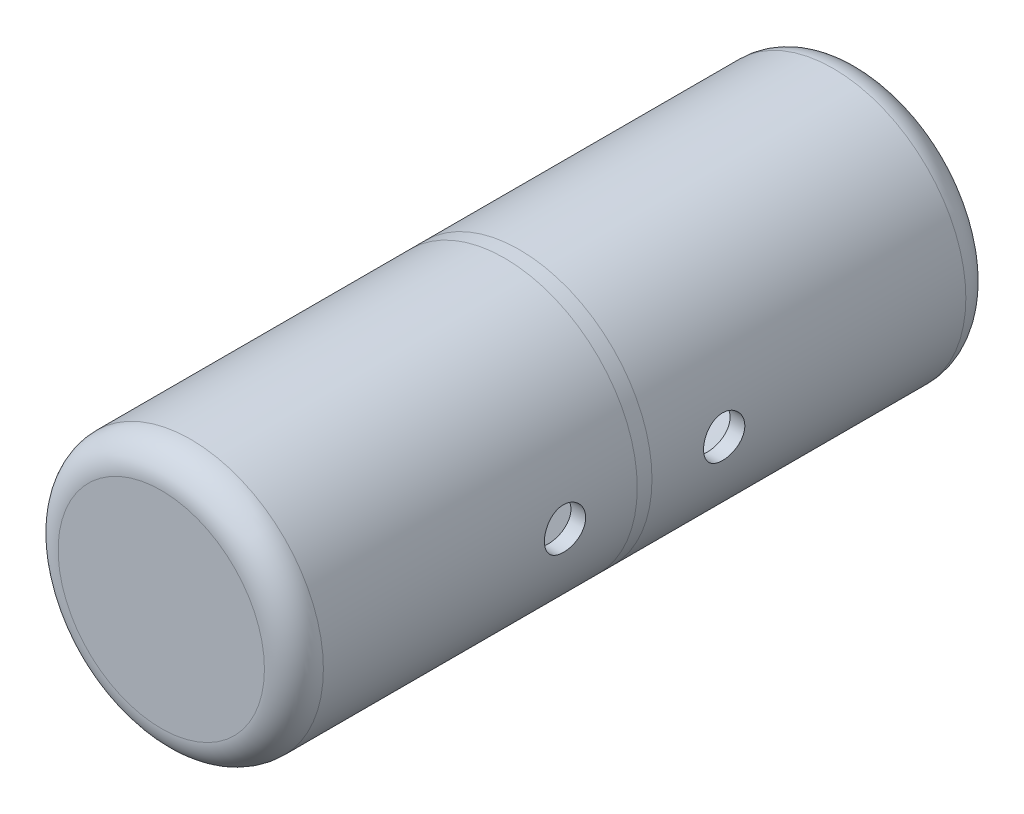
ISO-10303-21;
HEADER;
FILE_DESCRIPTION(('STEP AP214'),'2;1');
FILE_NAME('part.step','',(''),(''),'','','');
FILE_SCHEMA(('AUTOMOTIVE_DESIGN { 1 0 10303 214 1 1 1 1 }'));
ENDSEC;
DATA;
#1=APPLICATION_CONTEXT('core data for automotive mechanical design processes');
#2=APPLICATION_PROTOCOL_DEFINITION('international standard','automotive_design',2000,#1);
#3=PRODUCT_CONTEXT('',#1,'mechanical');
#4=PRODUCT('Part','Part','',(#3));
#5=PRODUCT_RELATED_PRODUCT_CATEGORY('part','',(#4));
#6=PRODUCT_DEFINITION_FORMATION('','',#4);
#7=PRODUCT_DEFINITION_CONTEXT('part definition',#1,'design');
#8=PRODUCT_DEFINITION('design','',#6,#7);
#9=PRODUCT_DEFINITION_SHAPE('','',#8);
#10=(LENGTH_UNIT() NAMED_UNIT(*) SI_UNIT(.MILLI.,.METRE.));
#11=(NAMED_UNIT(*) PLANE_ANGLE_UNIT() SI_UNIT($,.RADIAN.));
#12=(NAMED_UNIT(*) SI_UNIT($,.STERADIAN.) SOLID_ANGLE_UNIT());
#13=UNCERTAINTY_MEASURE_WITH_UNIT(LENGTH_MEASURE(1.E-05),#10,'distance_accuracy_value','');
#14=(GEOMETRIC_REPRESENTATION_CONTEXT(3) GLOBAL_UNCERTAINTY_ASSIGNED_CONTEXT((#13)) GLOBAL_UNIT_ASSIGNED_CONTEXT((#10,
#11,#12)) REPRESENTATION_CONTEXT('',''));
#15=CARTESIAN_POINT('',(0.,0.,0.));
#16=DIRECTION('',(0.,0.,1.));
#17=DIRECTION('',(1.,0.,0.));
#18=AXIS2_PLACEMENT_3D('',#15,#16,#17);
#19=CARTESIAN_POINT('',(0.,0.,-119.));
#20=DIRECTION('',(0.,0.,1.));
#21=DIRECTION('',(1.,0.,0.));
#22=AXIS2_PLACEMENT_3D('',#19,#20,#21);
#23=CYLINDRICAL_SURFACE('',#22,45.);
#24=CARTESIAN_POINT('',(0.,-45.,-19.));
#25=CARTESIAN_POINT('',(0.222875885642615,-45.0000017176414,-18.9999962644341));
#26=CARTESIAN_POINT('',(0.445702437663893,-44.9983412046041,-19.0093165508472));
#27=CARTESIAN_POINT('',(0.889819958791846,-44.9917492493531,-19.0465190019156));
#28=CARTESIAN_POINT('',(1.11111062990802,-44.9868171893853,-19.0744046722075));
#29=CARTESIAN_POINT('',(1.55062593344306,-44.9738139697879,-19.1485500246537));
#30=CARTESIAN_POINT('',(1.76884866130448,-44.9657409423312,-19.1948206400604));
#31=CARTESIAN_POINT('',(2.20063133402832,-44.9466788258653,-19.305397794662));
#32=CARTESIAN_POINT('',(2.41418953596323,-44.9356886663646,-19.3697109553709));
#33=CARTESIAN_POINT('',(2.83479614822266,-44.9111151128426,-19.5157877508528));
#34=CARTESIAN_POINT('',(3.04185233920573,-44.8975349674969,-19.5975295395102));
#35=CARTESIAN_POINT('',(3.44838067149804,-44.8681426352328,-19.7779405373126));
#36=CARTESIAN_POINT('',(3.64784994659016,-44.8523296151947,-19.876616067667));
#37=CARTESIAN_POINT('',(4.0376614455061,-44.8189194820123,-20.0901051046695));
#38=CARTESIAN_POINT('',(4.22800839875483,-44.8013233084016,-20.2049101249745));
#39=CARTESIAN_POINT('',(4.59849099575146,-44.7648137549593,-20.4499443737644));
#40=CARTESIAN_POINT('',(4.77862194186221,-44.7458997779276,-20.5801806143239));
#41=CARTESIAN_POINT('',(5.12906635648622,-44.7070918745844,-20.8564712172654));
#42=CARTESIAN_POINT('',(5.29926778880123,-44.6871902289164,-21.0026666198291));
#43=CARTESIAN_POINT('',(5.62670702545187,-44.6471428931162,-21.308746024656));
#44=CARTESIAN_POINT('',(5.78395052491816,-44.6269973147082,-21.4686239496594));
#45=CARTESIAN_POINT('',(6.08455450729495,-44.5870071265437,-21.8011109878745));
#46=CARTESIAN_POINT('',(6.22790847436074,-44.5671626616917,-21.9737260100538));
#47=CARTESIAN_POINT('',(6.4996098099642,-44.5283494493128,-22.3303842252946));
#48=CARTESIAN_POINT('',(6.62796243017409,-44.5093803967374,-22.5144233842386));
#49=CARTESIAN_POINT('',(6.86969217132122,-44.4727151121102,-22.8941085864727));
#50=CARTESIAN_POINT('',(6.98295361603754,-44.4550291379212,-23.0898292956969));
#51=CARTESIAN_POINT('',(7.19256295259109,-44.4215973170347,-23.4902832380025));
#52=CARTESIAN_POINT('',(7.28891113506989,-44.4058514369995,-23.6950163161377));
#53=CARTESIAN_POINT('',(7.46397089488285,-44.3767621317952,-24.1120464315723));
#54=CARTESIAN_POINT('',(7.54268315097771,-44.3634186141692,-24.3243431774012));
#55=CARTESIAN_POINT('',(7.68186820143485,-44.3395296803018,-24.7549824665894));
#56=CARTESIAN_POINT('',(7.74234156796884,-44.3289841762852,-24.9733248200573));
#57=CARTESIAN_POINT('',(7.84405206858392,-44.3110989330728,-25.4122127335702));
#58=CARTESIAN_POINT('',(7.88547991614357,-44.303727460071,-25.6327128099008));
#59=CARTESIAN_POINT('',(7.94966802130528,-44.2922548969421,-26.0764162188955));
#60=CARTESIAN_POINT('',(7.97243516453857,-44.2881526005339,-26.2996185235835));
#61=CARTESIAN_POINT('',(7.99914773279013,-44.2833356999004,-26.7472079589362));
#62=CARTESIAN_POINT('',(8.00309107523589,-44.2826214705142,-26.9715952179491));
#63=CARTESIAN_POINT('',(7.99211875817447,-44.284603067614,-27.4198921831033));
#64=CARTESIAN_POINT('',(7.97720322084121,-44.2872988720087,-27.6438018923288));
#65=CARTESIAN_POINT('',(7.92892410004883,-44.2959676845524,-28.086839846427));
#66=CARTESIAN_POINT('',(7.89578372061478,-44.3019010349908,-28.3059932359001));
#67=CARTESIAN_POINT('',(7.81145125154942,-44.3168485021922,-28.7407705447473));
#68=CARTESIAN_POINT('',(7.76025288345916,-44.3258636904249,-28.9563932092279));
#69=CARTESIAN_POINT('',(7.6402053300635,-44.3467131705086,-29.382487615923));
#70=CARTESIAN_POINT('',(7.57135904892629,-44.3585469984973,-29.5929601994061));
#71=CARTESIAN_POINT('',(7.41652110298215,-44.3846975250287,-30.0073476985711));
#72=CARTESIAN_POINT('',(7.33052886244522,-44.3990143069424,-30.211262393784));
#73=CARTESIAN_POINT('',(7.14151532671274,-44.4298094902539,-30.6122219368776));
#74=CARTESIAN_POINT('',(7.03840466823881,-44.4462991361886,-30.8092237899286));
#75=CARTESIAN_POINT('',(6.81621953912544,-44.4809148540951,-31.1938623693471));
#76=CARTESIAN_POINT('',(6.69714469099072,-44.4990409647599,-31.3814988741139));
#77=CARTESIAN_POINT('',(6.44385584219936,-44.536424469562,-31.7461571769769));
#78=CARTESIAN_POINT('',(6.30964083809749,-44.5556819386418,-31.9231782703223));
#79=CARTESIAN_POINT('',(6.02699588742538,-44.5947941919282,-32.2654131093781));
#80=CARTESIAN_POINT('',(5.8785658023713,-44.6146489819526,-32.4306267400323));
#81=CARTESIAN_POINT('',(5.56629349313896,-44.6546917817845,-32.7503931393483));
#82=CARTESIAN_POINT('',(5.40226278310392,-44.6748805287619,-32.9047618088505));
#83=CARTESIAN_POINT('',(5.06173920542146,-44.7147422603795,-33.1991492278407));
#84=CARTESIAN_POINT('',(4.88524648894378,-44.734415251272,-33.3391681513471));
#85=CARTESIAN_POINT('',(4.52099951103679,-44.7726936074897,-33.6038815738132));
#86=CARTESIAN_POINT('',(4.33324482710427,-44.7912989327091,-33.7285754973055));
#87=CARTESIAN_POINT('',(3.94777901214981,-44.8269170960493,-33.9617365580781));
#88=CARTESIAN_POINT('',(3.75006817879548,-44.8439299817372,-34.0702041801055));
#89=CARTESIAN_POINT('',(3.34580602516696,-44.8759037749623,-34.2702480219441));
#90=CARTESIAN_POINT('',(3.13924392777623,-44.8908620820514,-34.3618028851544));
#91=CARTESIAN_POINT('',(2.71904749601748,-44.9182712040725,-34.527133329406));
#92=CARTESIAN_POINT('',(2.5054157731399,-44.9307229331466,-34.6009153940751));
#93=CARTESIAN_POINT('',(2.07251608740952,-44.9527713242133,-34.7301817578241));
#94=CARTESIAN_POINT('',(1.85324752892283,-44.9623676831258,-34.78566411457));
#95=CARTESIAN_POINT('',(1.41069078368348,-44.9784278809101,-34.8778829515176));
#96=CARTESIAN_POINT('',(1.18740264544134,-44.9848917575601,-34.9146196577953));
#97=CARTESIAN_POINT('',(0.741480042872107,-44.9944359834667,-34.9686867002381));
#98=CARTESIAN_POINT('',(0.518877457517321,-44.9975608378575,-34.9862723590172));
#99=CARTESIAN_POINT('',(0.0728803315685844,-45.0004937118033,-35.0027808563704));
#100=CARTESIAN_POINT('',(-0.150514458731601,-45.0003005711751,-35.0016971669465));
#101=CARTESIAN_POINT('',(-0.596351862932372,-44.9966004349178,-34.980861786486));
#102=CARTESIAN_POINT('',(-0.818794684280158,-44.9930942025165,-34.9611143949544));
#103=CARTESIAN_POINT('',(-1.26118302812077,-44.9828675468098,-34.9031124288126));
#104=CARTESIAN_POINT('',(-1.48112850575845,-44.9761470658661,-34.8648575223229));
#105=CARTESIAN_POINT('',(-1.91542093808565,-44.959738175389,-34.7704696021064));
#106=CARTESIAN_POINT('',(-2.12979628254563,-44.9500708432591,-34.7144634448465));
#107=CARTESIAN_POINT('',(-2.55304077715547,-44.9280190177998,-34.5849168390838));
#108=CARTESIAN_POINT('',(-2.76190983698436,-44.9156344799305,-34.5113761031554));
#109=CARTESIAN_POINT('',(-3.17267709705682,-44.88848946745,-34.3473142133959));
#110=CARTESIAN_POINT('',(-3.37457615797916,-44.8737292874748,-34.2567951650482));
#111=CARTESIAN_POINT('',(-3.77012843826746,-44.8422291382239,-34.0593913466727));
#112=CARTESIAN_POINT('',(-3.96377891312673,-44.8254885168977,-33.952501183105));
#113=CARTESIAN_POINT('',(-4.3433146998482,-44.7903147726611,-33.7220079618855));
#114=CARTESIAN_POINT('',(-4.52910567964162,-44.7718667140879,-33.5982518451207));
#115=CARTESIAN_POINT('',(-4.88963340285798,-44.7339283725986,-33.3357094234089));
#116=CARTESIAN_POINT('',(-5.06437002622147,-44.7144380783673,-33.1969229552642));
#117=CARTESIAN_POINT('',(-5.40165158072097,-44.6749482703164,-32.9052417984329));
#118=CARTESIAN_POINT('',(-5.56419367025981,-44.6549486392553,-32.7523438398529));
#119=CARTESIAN_POINT('',(-5.87589519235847,-44.615003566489,-32.4335565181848));
#120=CARTESIAN_POINT('',(-6.02505884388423,-44.5950581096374,-32.2676712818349));
#121=CARTESIAN_POINT('',(-6.31076165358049,-44.5555309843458,-31.9219086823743));
#122=CARTESIAN_POINT('',(-6.44712687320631,-44.5359566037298,-31.74188670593));
#123=CARTESIAN_POINT('',(-6.70420391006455,-44.4979835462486,-31.3708789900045));
#124=CARTESIAN_POINT('',(-6.82491594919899,-44.4795848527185,-31.1798934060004));
#125=CARTESIAN_POINT('',(-7.0498177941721,-44.444493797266,-30.7882785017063));
#126=CARTESIAN_POINT('',(-7.15400760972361,-44.4278014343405,-30.5876491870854));
#127=CARTESIAN_POINT('',(-7.34509114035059,-44.3966103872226,-30.1781571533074));
#128=CARTESIAN_POINT('',(-7.43198536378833,-44.3821116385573,-29.9692946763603));
#129=CARTESIAN_POINT('',(-7.58748209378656,-44.3557923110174,-29.5457391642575));
#130=CARTESIAN_POINT('',(-7.65616261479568,-44.3439603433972,-29.3310754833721));
#131=CARTESIAN_POINT('',(-7.7751760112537,-44.3232477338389,-28.8966648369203));
#132=CARTESIAN_POINT('',(-7.82551564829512,-44.314366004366,-28.6769197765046));
#133=CARTESIAN_POINT('',(-7.90749041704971,-44.2998118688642,-28.2338396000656));
#134=CARTESIAN_POINT('',(-7.93912368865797,-44.2941397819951,-28.0105041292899));
#135=CARTESIAN_POINT('',(-7.9834245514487,-44.2861766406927,-27.5619008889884));
#136=CARTESIAN_POINT('',(-7.9960923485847,-44.2838855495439,-27.3366331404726));
#137=CARTESIAN_POINT('',(-8.00231582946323,-44.2827613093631,-26.88907973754));
#138=CARTESIAN_POINT('',(-7.99614466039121,-44.283878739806,-26.6667979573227));
#139=CARTESIAN_POINT('',(-7.96532527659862,-44.2894325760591,-26.2234825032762));
#140=CARTESIAN_POINT('',(-7.94067062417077,-44.2938701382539,-26.0024492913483));
#141=CARTESIAN_POINT('',(-7.87307592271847,-44.3059347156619,-25.5633321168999));
#142=CARTESIAN_POINT('',(-7.8301395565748,-44.3135610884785,-25.3452475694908));
#143=CARTESIAN_POINT('',(-7.72631110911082,-44.3317819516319,-24.9135169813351));
#144=CARTESIAN_POINT('',(-7.66541850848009,-44.3423765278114,-24.6998710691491));
#145=CARTESIAN_POINT('',(-7.52624599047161,-44.3662100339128,-24.2788412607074));
#146=CARTESIAN_POINT('',(-7.4479931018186,-44.3794448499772,-24.0714481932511));
#147=CARTESIAN_POINT('',(-7.27462070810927,-44.4081930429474,-23.6639973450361));
#148=CARTESIAN_POINT('',(-7.17950088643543,-44.423706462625,-23.4639397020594));
#149=CARTESIAN_POINT('',(-6.97307496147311,-44.4565759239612,-23.072509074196));
#150=CARTESIAN_POINT('',(-6.8617683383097,-44.4739320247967,-22.8811363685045));
#151=CARTESIAN_POINT('',(-6.62374962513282,-44.5100036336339,-22.5083581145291));
#152=CARTESIAN_POINT('',(-6.4970373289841,-44.5287191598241,-22.3269526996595));
#153=CARTESIAN_POINT('',(-6.2272651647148,-44.5672522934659,-21.9729372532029));
#154=CARTESIAN_POINT('',(-6.08400772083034,-44.5870813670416,-21.8004789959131));
#155=CARTESIAN_POINT('',(-5.78355260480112,-44.6270487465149,-21.4682111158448));
#156=CARTESIAN_POINT('',(-5.62635512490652,-44.6471870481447,-21.3084013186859));
#157=CARTESIAN_POINT('',(-5.299049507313,-44.6872158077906,-21.0024783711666));
#158=CARTESIAN_POINT('',(-5.12893814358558,-44.7071062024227,-20.8563686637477));
#159=CARTESIAN_POINT('',(-4.77700001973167,-44.7460792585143,-20.5789033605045));
#160=CARTESIAN_POINT('',(-4.59517352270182,-44.7651619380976,-20.4475474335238));
#161=CARTESIAN_POINT('',(-4.21950299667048,-44.8021394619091,-20.199494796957));
#162=CARTESIAN_POINT('',(-4.025572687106,-44.8200232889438,-20.0829270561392));
#163=CARTESIAN_POINT('',(-3.62848426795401,-44.8539161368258,-19.8666134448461));
#164=CARTESIAN_POINT('',(-3.42532958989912,-44.8699258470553,-19.76686138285));
#165=CARTESIAN_POINT('',(-3.0112869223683,-44.8996122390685,-19.5849316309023));
#166=CARTESIAN_POINT('',(-2.80040419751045,-44.9132904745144,-19.5027422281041));
#167=CARTESIAN_POINT('',(-2.37236082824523,-44.9379337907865,-19.3565014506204));
#168=CARTESIAN_POINT('',(-2.1552014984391,-44.9488994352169,-19.2924463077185));
#169=CARTESIAN_POINT('',(-1.61969489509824,-44.971950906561,-19.1589215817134));
#170=CARTESIAN_POINT('',(-1.29874234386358,-44.9824185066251,-19.099399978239));
#171=CARTESIAN_POINT('',(-0.65182463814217,-44.9964417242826,-19.0199423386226));
#172=CARTESIAN_POINT('',(-0.325859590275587,-44.9999974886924,-19.0000054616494));
#173=CARTESIAN_POINT('',(0.,-45.,-19.));
#174=B_SPLINE_CURVE_WITH_KNOTS('',3,(#24,#25,#26,#27,#28,#29,#30,#31,#32,#33,#34,#35,#36,#37,
#38,#39,#40,#41,#42,#43,#44,#45,#46,#47,#48,#49,#50,#51,#52,#53,#54,#55,#56,#57,#58,#59,#60,#61,
#62,#63,#64,#65,#66,#67,#68,#69,#70,#71,#72,#73,#74,#75,#76,#77,#78,#79,#80,#81,#82,#83,#84,#85,
#86,#87,#88,#89,#90,#91,#92,#93,#94,#95,#96,#97,#98,#99,#100,#101,#102,#103,#104,#105,#106,#107,
#108,#109,#110,#111,#112,#113,#114,#115,#116,#117,#118,#119,#120,#121,#122,#123,#124,#125,#126,
#127,#128,#129,#130,#131,#132,#133,#134,#135,#136,#137,#138,#139,#140,#141,#142,#143,#144,#145,
#146,#147,#148,#149,#150,#151,#152,#153,#154,#155,#156,#157,#158,#159,#160,#161,#162,#163,#164,
#165,#166,#167,#168,#169,#170,#171,#172,#173),.UNSPECIFIED.,.T.,.F.,(4,2,2,2,2,2,2,2,2,2,2,2,2,
2,2,2,2,2,2,2,2,2,2,2,2,2,2,2,2,2,2,2,2,2,2,2,2,2,2,2,2,2,2,2,2,2,2,2,2,2,2,2,2,2,2,2,2,2,2,2,2,
2,2,2,2,2,2,2,2,2,2,2,2,2,4),(0.,0.668341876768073,1.33680998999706,2.00567622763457,
2.67478825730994,3.34306646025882,4.01159467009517,4.6797724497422,5.3482550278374,
6.02321476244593,6.69787624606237,7.37285270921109,8.04759216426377,8.72723779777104,
9.40687175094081,10.0864795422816,10.7660660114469,11.4386906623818,12.1110670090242,
12.7835177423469,13.4559641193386,14.1203525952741,14.7849722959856,15.4494826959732,
16.1140154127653,16.7821330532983,17.4502664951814,18.1184442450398,18.7866285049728,
19.4642749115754,20.1419130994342,20.8195767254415,21.4972201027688,22.1757134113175,
22.8539588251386,23.5322762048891,24.2105854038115,24.8797362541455,25.5491210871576,
26.2183517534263,26.8875944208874,27.5521583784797,28.2167332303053,28.8812257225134,
29.5459376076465,30.2171426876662,30.8883550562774,31.5597233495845,32.230879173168,
32.9101288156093,33.5893688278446,34.2686084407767,34.9478280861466,35.6240896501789,
36.3001016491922,36.9761808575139,37.6522527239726,38.3185689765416,38.9851174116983,
39.6515316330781,40.3179651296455,40.9833682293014,41.6487838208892,42.3142207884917,
42.9796666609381,43.6540948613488,44.3285137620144,45.0031016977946,45.6776744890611,
46.3577760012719,47.0376265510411,47.717022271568,48.3962767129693,49.373458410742,
50.3506193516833),.UNSPECIFIED.);
#175=CARTESIAN_POINT('',(0.,-45.,-19.));
#176=VERTEX_POINT('',#175);
#177=EDGE_CURVE('E67',#176,#176,#174,.T.);
#178=ORIENTED_EDGE('',*,*,#177,.T.);
#179=EDGE_LOOP('',(#178));
#180=FACE_BOUND('',#179,.T.);
#181=CARTESIAN_POINT('',(0.,0.,-2.5));
#182=DIRECTION('',(0.,0.,-1.));
#183=DIRECTION('',(-1.,0.,0.));
#184=AXIS2_PLACEMENT_3D('',#181,#182,#183);
#185=CIRCLE('',#184,45.);
#186=CARTESIAN_POINT('',(-45.,0.,-2.5));
#187=VERTEX_POINT('',#186);
#188=EDGE_CURVE('E58',#187,#187,#185,.T.);
#189=ORIENTED_EDGE('',*,*,#188,.T.);
#190=EDGE_LOOP('',(#189));
#191=FACE_BOUND('',#190,.T.);
#192=CARTESIAN_POINT('',(0.,0.,-109.));
#193=DIRECTION('',(0.,0.,-1.));
#194=DIRECTION('',(-1.,0.,0.));
#195=AXIS2_PLACEMENT_3D('',#192,#193,#194);
#196=CIRCLE('',#195,45.);
#197=CARTESIAN_POINT('',(-45.,0.,-109.));
#198=VERTEX_POINT('',#197);
#199=EDGE_CURVE('E11',#198,#198,#196,.F.);
#200=ORIENTED_EDGE('',*,*,#199,.T.);
#201=EDGE_LOOP('',(#200));
#202=FACE_BOUND('',#201,.T.);
#203=CARTESIAN_POINT('',(45.,0.,-34.));
#204=CARTESIAN_POINT('',(45.0000011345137,0.195399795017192,-34.0000027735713));
#205=CARTESIAN_POINT('',(44.9987248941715,0.390761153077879,-33.9918156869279));
#206=CARTESIAN_POINT('',(44.9936580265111,0.78014287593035,-33.9591335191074));
#207=CARTESIAN_POINT('',(44.9898668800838,0.974162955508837,-33.9346350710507));
#208=CARTESIAN_POINT('',(44.979871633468,1.35953622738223,-33.869489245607));
#209=CARTESIAN_POINT('',(44.9736659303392,1.55088756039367,-33.8288311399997));
#210=CARTESIAN_POINT('',(44.9590135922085,1.92950809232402,-33.7316572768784));
#211=CARTESIAN_POINT('',(44.9505661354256,2.11677576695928,-33.6751357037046));
#212=CARTESIAN_POINT('',(44.931678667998,2.48562242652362,-33.5467374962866));
#213=CARTESIAN_POINT('',(44.9212409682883,2.66720772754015,-33.4748786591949));
#214=CARTESIAN_POINT('',(44.8986529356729,3.02372006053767,-33.3162644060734));
#215=CARTESIAN_POINT('',(44.8865019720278,3.19864461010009,-33.2295035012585));
#216=CARTESIAN_POINT('',(44.8608338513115,3.5404734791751,-33.0417754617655));
#217=CARTESIAN_POINT('',(44.8473173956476,3.7073818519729,-32.9408156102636));
#218=CARTESIAN_POINT('',(44.8192812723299,4.03219716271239,-32.7253284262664));
#219=CARTESIAN_POINT('',(44.8047612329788,4.19010072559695,-32.610796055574));
#220=CARTESIAN_POINT('',(44.7750173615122,4.49685893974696,-32.3681261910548));
#221=CARTESIAN_POINT('',(44.7597892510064,4.64564107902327,-32.2398975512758));
#222=CARTESIAN_POINT('',(44.729147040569,4.93195159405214,-31.9713569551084));
#223=CARTESIAN_POINT('',(44.7137328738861,5.06947578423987,-31.8310405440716));
#224=CARTESIAN_POINT('',(44.6831615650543,5.33221950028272,-31.5393775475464));
#225=CARTESIAN_POINT('',(44.6680043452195,5.45744280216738,-31.3880343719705));
#226=CARTESIAN_POINT('',(44.6383637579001,5.69480433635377,-31.0752618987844));
#227=CARTESIAN_POINT('',(44.6238806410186,5.80693772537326,-30.9138289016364));
#228=CARTESIAN_POINT('',(44.5959333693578,6.01781547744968,-30.5811836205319));
#229=CARTESIAN_POINT('',(44.5824748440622,6.11648794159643,-30.4099252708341));
#230=CARTESIAN_POINT('',(44.5570485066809,6.2990417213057,-30.0595896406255));
#231=CARTESIAN_POINT('',(44.5450807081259,6.38292290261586,-29.8805122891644));
#232=CARTESIAN_POINT('',(44.522985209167,6.53526713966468,-29.5158166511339));
#233=CARTESIAN_POINT('',(44.5128573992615,6.60373111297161,-29.3301987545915));
#234=CARTESIAN_POINT('',(44.4947383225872,6.72473105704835,-28.9537359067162));
#235=CARTESIAN_POINT('',(44.4867470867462,6.77726679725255,-28.7628908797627));
#236=CARTESIAN_POINT('',(44.473193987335,6.86563920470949,-28.3789427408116));
#237=CARTESIAN_POINT('',(44.4676126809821,6.90160968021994,-28.1858711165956));
#238=CARTESIAN_POINT('',(44.4589460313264,6.95721983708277,-27.797268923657));
#239=CARTESIAN_POINT('',(44.455861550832,6.97685387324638,-27.6017375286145));
#240=CARTESIAN_POINT('',(44.4522850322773,6.9996074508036,-27.2097603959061));
#241=CARTESIAN_POINT('',(44.4517919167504,7.002733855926,-27.0133150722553));
#242=CARTESIAN_POINT('',(44.4534038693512,6.99248540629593,-26.6208463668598));
#243=CARTESIAN_POINT('',(44.4555098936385,6.97910447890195,-26.4248231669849));
#244=CARTESIAN_POINT('',(44.4656013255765,6.91466644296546,-25.8431697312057));
#245=CARTESIAN_POINT('',(44.4773258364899,6.83953815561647,-25.4599778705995));
#246=CARTESIAN_POINT('',(44.5094954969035,6.62692497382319,-24.7119193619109));
#247=CARTESIAN_POINT('',(44.5299409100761,6.48943819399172,-24.3470532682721));
#248=CARTESIAN_POINT('',(44.5773423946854,6.15540508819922,-23.6439584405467));
#249=CARTESIAN_POINT('',(44.6043255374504,5.95861234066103,-23.3058484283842));
#250=CARTESIAN_POINT('',(44.6617445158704,5.51172929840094,-22.6672429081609));
#251=CARTESIAN_POINT('',(44.6921805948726,5.26163524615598,-22.3667500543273));
#252=CARTESIAN_POINT('',(44.7534775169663,4.71204260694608,-21.8084971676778));
#253=CARTESIAN_POINT('',(44.7843394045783,4.41204097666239,-21.5512321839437));
#254=CARTESIAN_POINT('',(44.8427067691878,3.77285940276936,-21.0906251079));
#255=CARTESIAN_POINT('',(44.87021222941,3.43367926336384,-20.8872832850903));
#256=CARTESIAN_POINT('',(44.9187995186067,2.72532789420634,-20.5402614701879));
#257=CARTESIAN_POINT('',(44.9398770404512,2.35613676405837,-20.3966214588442));
#258=CARTESIAN_POINT('',(44.9731980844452,1.59847088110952,-20.1735208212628));
#259=CARTESIAN_POINT('',(44.9854422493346,1.2099975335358,-20.0940555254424));
#260=CARTESIAN_POINT('',(44.9996314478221,0.4290657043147,-20.0022223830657));
#261=CARTESIAN_POINT('',(45.0016809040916,0.0366890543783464,-19.9891742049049));
#262=CARTESIAN_POINT('',(44.9955345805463,-0.744647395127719,-20.0287374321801));
#263=CARTESIAN_POINT('',(44.9873391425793,-1.13360730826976,-20.0813466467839));
#264=CARTESIAN_POINT('',(44.96168847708,-1.89499520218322,-20.2501651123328));
#265=CARTESIAN_POINT('',(44.9442817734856,-2.26749883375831,-20.3660411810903));
#266=CARTESIAN_POINT('',(44.9021534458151,-2.9877916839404,-20.6577528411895));
#267=CARTESIAN_POINT('',(44.8774314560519,-3.33557966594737,-20.8335914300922));
#268=CARTESIAN_POINT('',(44.8231589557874,-3.99954737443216,-21.2418154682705));
#269=CARTESIAN_POINT('',(44.7935723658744,-4.31546005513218,-21.474630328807));
#270=CARTESIAN_POINT('',(44.7329710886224,-4.90397686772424,-21.9896218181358));
#271=CARTESIAN_POINT('',(44.7019563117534,-5.17657827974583,-22.2718015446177));
#272=CARTESIAN_POINT('',(44.6416622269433,-5.67320669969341,-22.8804767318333));
#273=CARTESIAN_POINT('',(44.6124009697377,-5.89677633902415,-23.2073467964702));
#274=CARTESIAN_POINT('',(44.5592474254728,-6.28588029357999,-23.8946188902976));
#275=CARTESIAN_POINT('',(44.5353549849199,-6.45141626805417,-24.2550199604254));
#276=CARTESIAN_POINT('',(44.5056548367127,-6.6521504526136,-24.8118848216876));
#277=CARTESIAN_POINT('',(44.4967856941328,-6.71108611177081,-24.9999532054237));
#278=CARTESIAN_POINT('',(44.4813094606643,-6.81291413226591,-25.3804587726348));
#279=CARTESIAN_POINT('',(44.474701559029,-6.8558122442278,-25.5728943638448));
#280=CARTESIAN_POINT('',(44.4639445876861,-6.92523349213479,-25.9607767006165));
#281=CARTESIAN_POINT('',(44.4597958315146,-6.95175454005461,-26.156223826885));
#282=CARTESIAN_POINT('',(44.454079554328,-6.98821546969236,-26.5486946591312));
#283=CARTESIAN_POINT('',(44.4525119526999,-6.99815586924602,-26.7457183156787));
#284=CARTESIAN_POINT('',(44.4520074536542,-7.00135944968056,-27.1377685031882));
#285=CARTESIAN_POINT('',(44.4530422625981,-6.99480199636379,-27.3327935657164));
#286=CARTESIAN_POINT('',(44.4576528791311,-6.96543759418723,-27.7215832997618));
#287=CARTESIAN_POINT('',(44.4612286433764,-6.94263092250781,-27.9153479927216));
#288=CARTESIAN_POINT('',(44.4708183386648,-6.88093663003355,-28.3002738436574));
#289=CARTESIAN_POINT('',(44.4768327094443,-6.84204610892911,-28.4914345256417));
#290=CARTESIAN_POINT('',(44.4911233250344,-6.74849468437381,-28.8696963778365));
#291=CARTESIAN_POINT('',(44.4993987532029,-6.69383947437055,-29.0567989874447));
#292=CARTESIAN_POINT('',(44.5179702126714,-6.56919269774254,-29.4256085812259));
#293=CARTESIAN_POINT('',(44.5282651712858,-6.49920927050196,-29.6073183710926));
#294=CARTESIAN_POINT('',(44.5505818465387,-6.3444278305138,-29.9641254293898));
#295=CARTESIAN_POINT('',(44.5626029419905,-6.25963514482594,-30.1392250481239));
#296=CARTESIAN_POINT('',(44.5880410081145,-6.07578878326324,-30.4817504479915));
#297=CARTESIAN_POINT('',(44.6014585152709,-5.97672962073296,-30.6491732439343));
#298=CARTESIAN_POINT('',(44.6293054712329,-5.7651083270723,-30.9750802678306));
#299=CARTESIAN_POINT('',(44.6437345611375,-5.65255097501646,-31.1335676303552));
#300=CARTESIAN_POINT('',(44.6733668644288,-5.41340557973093,-31.4422477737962));
#301=CARTESIAN_POINT('',(44.6885767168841,-5.28668009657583,-31.5923334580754));
#302=CARTESIAN_POINT('',(44.7191918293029,-5.0211287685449,-31.8812654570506));
#303=CARTESIAN_POINT('',(44.7345970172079,-4.8823072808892,-32.0201157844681));
#304=CARTESIAN_POINT('',(44.7651855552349,-4.5933942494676,-32.2857602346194));
#305=CARTESIAN_POINT('',(44.7803687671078,-4.4432960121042,-32.412547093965));
#306=CARTESIAN_POINT('',(44.8100731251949,-4.13299231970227,-32.6530427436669));
#307=CARTESIAN_POINT('',(44.8245945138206,-3.97279061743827,-32.766756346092));
#308=CARTESIAN_POINT('',(44.8526634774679,-3.64228654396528,-32.9810349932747));
#309=CARTESIAN_POINT('',(44.8662042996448,-3.47192660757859,-33.0815121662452));
#310=CARTESIAN_POINT('',(44.8918206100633,-3.12329623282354,-33.2676997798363));
#311=CARTESIAN_POINT('',(44.9038966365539,-2.94502873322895,-33.3534156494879));
#312=CARTESIAN_POINT('',(44.9262372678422,-2.58190920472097,-33.5094361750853));
#313=CARTESIAN_POINT('',(44.9365031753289,-2.39706202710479,-33.5797519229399));
#314=CARTESIAN_POINT('',(44.9549394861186,-2.02204831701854,-33.7045043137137));
#315=CARTESIAN_POINT('',(44.963110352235,-1.83188296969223,-33.75894446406));
#316=CARTESIAN_POINT('',(44.9798880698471,-1.3716640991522,-33.8698242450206));
#317=CARTESIAN_POINT('',(44.9873959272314,-1.09968266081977,-33.9185845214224));
#318=CARTESIAN_POINT('',(44.9974510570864,-0.551775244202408,-33.9836702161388));
#319=CARTESIAN_POINT('',(44.9999983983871,-0.275849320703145,-33.9999960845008));
#320=CARTESIAN_POINT('',(45.,0.,-34.));
#321=B_SPLINE_CURVE_WITH_KNOTS('',3,(#203,#204,#205,#206,#207,#208,#209,#210,#211,#212,#213,
#214,#215,#216,#217,#218,#219,#220,#221,#222,#223,#224,#225,#226,#227,#228,#229,#230,#231,#232,
#233,#234,#235,#236,#237,#238,#239,#240,#241,#242,#243,#244,#245,#246,#247,#248,#249,#250,#251,
#252,#253,#254,#255,#256,#257,#258,#259,#260,#261,#262,#263,#264,#265,#266,#267,#268,#269,#270,
#271,#272,#273,#274,#275,#276,#277,#278,#279,#280,#281,#282,#283,#284,#285,#286,#287,#288,#289,
#290,#291,#292,#293,#294,#295,#296,#297,#298,#299,#300,#301,#302,#303,#304,#305,#306,#307,#308,
#309,#310,#311,#312,#313,#314,#315,#316,#317,#318,#319,#320),.UNSPECIFIED.,.T.,.F.,(4,2,2,2,2,2,
2,2,2,2,2,2,2,2,2,2,2,2,2,2,2,2,2,2,2,2,2,2,2,2,2,2,2,2,2,2,2,2,2,2,2,2,2,2,2,2,2,2,2,2,2,2,2,2,
2,2,2,2,4),(0.,0.5859577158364,1.17203641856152,1.75850486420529,2.34518859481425,
2.93119521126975,3.51741813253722,4.10334144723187,4.68948294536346,5.27980186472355,
5.87033926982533,6.46069482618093,7.05126812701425,7.64488171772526,8.23850069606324,
8.83208433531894,9.42567656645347,10.014386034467,10.6032988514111,11.1919667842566,
11.7808513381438,12.946820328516,14.1128245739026,15.2837420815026,16.4547421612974,
17.6383529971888,18.8219697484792,20.00637786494,21.1906997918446,22.3628655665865,
23.5349922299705,24.701004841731,25.867075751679,27.0422212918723,28.2174405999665,
29.4031955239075,30.5889165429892,31.1801889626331,31.7712491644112,32.3623847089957,
32.9535017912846,33.5382200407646,34.1229283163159,34.7077420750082,35.2923448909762,
35.876638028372,36.4607214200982,37.0450300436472,37.6291323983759,38.2194946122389,
38.8096450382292,39.4001485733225,39.9904340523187,40.5844594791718,41.1782659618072,
41.7716433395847,42.3648895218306,43.1921077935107,44.0193145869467),.UNSPECIFIED.);
#322=CARTESIAN_POINT('',(45.,0.,-34.));
#323=VERTEX_POINT('',#322);
#324=EDGE_CURVE('E66',#323,#323,#321,.T.);
#325=ORIENTED_EDGE('',*,*,#324,.F.);
#326=EDGE_LOOP('',(#325));
#327=FACE_BOUND('',#326,.T.);
#328=ADVANCED_FACE('F41',(#180,#191,#202,#327),#23,.T.);
#329=CARTESIAN_POINT('',(0.,0.,-119.));
#330=DIRECTION('',(0.,0.,1.));
#331=DIRECTION('',(1.,0.,0.));
#332=AXIS2_PLACEMENT_3D('',#329,#330,#331);
#333=CYLINDRICAL_SURFACE('',#332,40.);
#334=CARTESIAN_POINT('',(0.,-40.,-19.));
#335=CARTESIAN_POINT('',(0.222382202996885,-40.0000022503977,-18.9999955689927));
#336=CARTESIAN_POINT('',(0.444708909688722,-39.9981422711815,-19.0092749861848));
#337=CARTESIAN_POINT('',(0.887823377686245,-39.9907591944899,-19.0463103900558));
#338=CARTESIAN_POINT('',(1.10861087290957,-39.9852354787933,-19.0740694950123));
#339=CARTESIAN_POINT('',(1.54709944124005,-39.9706723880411,-19.1478697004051));
#340=CARTESIAN_POINT('',(1.76479885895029,-39.961631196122,-19.1939202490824));
#341=CARTESIAN_POINT('',(2.19553774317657,-39.9402820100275,-19.3039594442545));
#342=CARTESIAN_POINT('',(2.40857546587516,-39.9279728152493,-19.3679546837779));
#343=CARTESIAN_POINT('',(2.82813260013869,-39.9004487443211,-19.5132858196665));
#344=CARTESIAN_POINT('',(3.03466039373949,-39.8852377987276,-19.5945982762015));
#345=CARTESIAN_POINT('',(3.44015899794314,-39.8523111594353,-19.77404109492));
#346=CARTESIAN_POINT('',(3.63912695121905,-39.8345945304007,-19.8721777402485));
#347=CARTESIAN_POINT('',(4.02798849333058,-39.7971537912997,-20.0844843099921));
#348=CARTESIAN_POINT('',(4.21788648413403,-39.7774306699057,-20.1986463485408));
#349=CARTESIAN_POINT('',(4.5875374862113,-39.7364958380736,-20.4422927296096));
#350=CARTESIAN_POINT('',(4.76728582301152,-39.7152834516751,-20.5717840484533));
#351=CARTESIAN_POINT('',(5.11747697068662,-39.6716894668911,-20.8468220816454));
#352=CARTESIAN_POINT('',(5.2877803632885,-39.6492968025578,-20.992544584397));
#353=CARTESIAN_POINT('',(5.61547151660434,-39.6042147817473,-21.2976689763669));
#354=CARTESIAN_POINT('',(5.77286491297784,-39.5815255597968,-21.4570648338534));
#355=CARTESIAN_POINT('',(6.07382890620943,-39.5364613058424,-21.7885943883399));
#356=CARTESIAN_POINT('',(6.21739288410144,-39.5140864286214,-21.9607341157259));
#357=CARTESIAN_POINT('',(6.48957938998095,-39.4702971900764,-22.316465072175));
#358=CARTESIAN_POINT('',(6.61820714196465,-39.4488824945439,-22.5000522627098));
#359=CARTESIAN_POINT('',(6.86080252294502,-39.4074190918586,-22.879257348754));
#360=CARTESIAN_POINT('',(6.97462249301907,-39.3873849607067,-23.0749713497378));
#361=CARTESIAN_POINT('',(7.18534213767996,-39.3494895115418,-23.4755050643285));
#362=CARTESIAN_POINT('',(7.28224207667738,-39.331628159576,-23.6803246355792));
#363=CARTESIAN_POINT('',(7.4583833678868,-39.2986075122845,-24.097620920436));
#364=CARTESIAN_POINT('',(7.53762568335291,-39.2834480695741,-24.3100972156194));
#365=CARTESIAN_POINT('',(7.67783429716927,-39.2562856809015,-24.7411880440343));
#366=CARTESIAN_POINT('',(7.73880125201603,-39.244282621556,-24.9598023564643));
#367=CARTESIAN_POINT('',(7.84130382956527,-39.2239295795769,-25.3987234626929));
#368=CARTESIAN_POINT('',(7.88308020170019,-39.2155344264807,-25.6189719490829));
#369=CARTESIAN_POINT('',(7.94800155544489,-39.2024281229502,-26.0622243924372));
#370=CARTESIAN_POINT('',(7.97115349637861,-39.1977155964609,-26.2852272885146));
#371=CARTESIAN_POINT('',(7.99866360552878,-39.1921111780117,-26.7324582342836));
#372=CARTESIAN_POINT('',(8.00302002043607,-39.1912196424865,-26.9566863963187));
#373=CARTESIAN_POINT('',(7.9928982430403,-39.1932851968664,-27.4046983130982));
#374=CARTESIAN_POINT('',(7.97842020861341,-39.1962422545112,-27.6284820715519));
#375=CARTESIAN_POINT('',(7.93111398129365,-39.205841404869,-28.0705569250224));
#376=CARTESIAN_POINT('',(7.89856956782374,-39.2124264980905,-28.2888796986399));
#377=CARTESIAN_POINT('',(7.81557589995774,-39.2290525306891,-28.722039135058));
#378=CARTESIAN_POINT('',(7.76512043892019,-39.2390946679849,-28.9368745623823));
#379=CARTESIAN_POINT('',(7.64671600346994,-39.2623403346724,-29.3614155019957));
#380=CARTESIAN_POINT('',(7.57877276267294,-39.2755428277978,-29.5711226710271));
#381=CARTESIAN_POINT('',(7.42586773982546,-39.3047394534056,-29.9841238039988));
#382=CARTESIAN_POINT('',(7.34089962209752,-39.3207346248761,-30.1874153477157));
#383=CARTESIAN_POINT('',(7.15397048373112,-39.3551749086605,-30.587445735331));
#384=CARTESIAN_POINT('',(7.05190184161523,-39.3736353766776,-30.7841329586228));
#385=CARTESIAN_POINT('',(6.83189481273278,-39.4124052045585,-31.1682371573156));
#386=CARTESIAN_POINT('',(6.7139558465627,-39.4327146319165,-31.3556537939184));
#387=CARTESIAN_POINT('',(6.46302077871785,-39.4746189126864,-31.7199887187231));
#388=CARTESIAN_POINT('',(6.33002347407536,-39.4962138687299,-31.8969061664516));
#389=CARTESIAN_POINT('',(6.04987994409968,-39.5400941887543,-32.2390689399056));
#390=CARTESIAN_POINT('',(5.9027335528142,-39.5623795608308,-32.4043141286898));
#391=CARTESIAN_POINT('',(5.59249627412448,-39.6074360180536,-32.7249134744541));
#392=CARTESIAN_POINT('',(5.42916581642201,-39.6302086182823,-32.8800356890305));
#393=CARTESIAN_POINT('',(5.08996999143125,-39.6751996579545,-33.1759910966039));
#394=CARTESIAN_POINT('',(4.91410485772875,-39.6974181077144,-33.3168245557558));
#395=CARTESIAN_POINT('',(4.55098875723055,-39.7406835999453,-33.5832530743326));
#396=CARTESIAN_POINT('',(4.36373525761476,-39.7617303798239,-33.7088447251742));
#397=CARTESIAN_POINT('',(3.97922978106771,-39.8020486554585,-33.9438082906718));
#398=CARTESIAN_POINT('',(3.78198164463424,-39.8213208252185,-34.0531863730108));
#399=CARTESIAN_POINT('',(3.37838910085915,-39.8575916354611,-34.2551710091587));
#400=CARTESIAN_POINT('',(3.17202770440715,-39.8745857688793,-34.347744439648));
#401=CARTESIAN_POINT('',(2.7520988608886,-39.9057672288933,-34.5151194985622));
#402=CARTESIAN_POINT('',(2.53853405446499,-39.9199555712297,-34.5899275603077));
#403=CARTESIAN_POINT('',(2.10564163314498,-39.9451283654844,-34.7212328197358));
#404=CARTESIAN_POINT('',(1.88631353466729,-39.9561125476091,-34.7777284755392));
#405=CARTESIAN_POINT('',(1.44351590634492,-39.9745588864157,-34.8719435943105));
#406=CARTESIAN_POINT('',(1.22004644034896,-39.9820210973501,-34.9096633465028));
#407=CARTESIAN_POINT('',(0.774384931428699,-39.9931141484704,-34.9655455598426));
#408=CARTESIAN_POINT('',(0.552234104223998,-39.9968070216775,-34.9840247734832));
#409=CARTESIAN_POINT('',(0.107135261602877,-40.0004756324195,-35.0023829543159));
#410=CARTESIAN_POINT('',(-0.115812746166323,-40.0004514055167,-35.0022620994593));
#411=CARTESIAN_POINT('',(-0.560877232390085,-39.9966866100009,-34.983421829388));
#412=CARTESIAN_POINT('',(-0.782993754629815,-39.99294623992,-34.964703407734));
#413=CARTESIAN_POINT('',(-1.22480186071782,-39.9818545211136,-34.9088203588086));
#414=CARTESIAN_POINT('',(-1.44449344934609,-39.9745031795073,-34.8716557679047));
#415=CARTESIAN_POINT('',(-1.87787554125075,-39.9564787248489,-34.7796019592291));
#416=CARTESIAN_POINT('',(-2.09160263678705,-39.9458367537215,-34.724878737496));
#417=CARTESIAN_POINT('',(-2.51372209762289,-39.9214968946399,-34.5980121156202));
#418=CARTESIAN_POINT('',(-2.72211261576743,-39.9077979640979,-34.5258627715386));
#419=CARTESIAN_POINT('',(-3.13200198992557,-39.877722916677,-34.3647162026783));
#420=CARTESIAN_POINT('',(-3.33350282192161,-39.861347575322,-34.2757238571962));
#421=CARTESIAN_POINT('',(-3.72839698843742,-39.8263526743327,-34.0814893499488));
#422=CARTESIAN_POINT('',(-3.92178742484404,-39.8077323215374,-33.9762414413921));
#423=CARTESIAN_POINT('',(-4.30138936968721,-39.7685164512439,-33.7488950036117));
#424=CARTESIAN_POINT('',(-4.48748613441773,-39.7478998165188,-33.6266085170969));
#425=CARTESIAN_POINT('',(-4.84875465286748,-39.7054488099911,-33.3670286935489));
#426=CARTESIAN_POINT('',(-5.023926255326,-39.6836144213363,-33.2297351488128));
#427=CARTESIAN_POINT('',(-5.36222509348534,-39.6393195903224,-32.9410437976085));
#428=CARTESIAN_POINT('',(-5.52534929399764,-39.6168589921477,-32.7896424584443));
#429=CARTESIAN_POINT('',(-5.83837217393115,-39.5719396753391,-32.4738310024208));
#430=CARTESIAN_POINT('',(-5.98827496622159,-39.5494809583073,-32.3094249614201));
#431=CARTESIAN_POINT('',(-6.2761128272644,-39.5048345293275,-31.9660216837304));
#432=CARTESIAN_POINT('',(-6.41382763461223,-39.4826563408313,-31.7868384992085));
#433=CARTESIAN_POINT('',(-6.67367154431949,-39.4395671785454,-31.417365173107));
#434=CARTESIAN_POINT('',(-6.79580081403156,-39.41865619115,-31.2270751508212));
#435=CARTESIAN_POINT('',(-7.02359296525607,-39.3787064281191,-30.8366929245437));
#436=CARTESIAN_POINT('',(-7.12925589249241,-39.3596676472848,-30.6366007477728));
#437=CARTESIAN_POINT('',(-7.32332467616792,-39.3240213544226,-30.2280124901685));
#438=CARTESIAN_POINT('',(-7.41173110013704,-39.3074137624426,-30.0195166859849));
#439=CARTESIAN_POINT('',(-7.57020898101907,-39.277199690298,-29.596662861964));
#440=CARTESIAN_POINT('',(-7.64037073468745,-39.2635784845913,-29.382339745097));
#441=CARTESIAN_POINT('',(-7.76236677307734,-39.2396423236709,-28.9484427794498));
#442=CARTESIAN_POINT('',(-7.81420789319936,-39.2293261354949,-28.7288709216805));
#443=CARTESIAN_POINT('',(-7.89918364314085,-39.2123039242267,-28.2859800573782));
#444=CARTESIAN_POINT('',(-7.93231684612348,-39.2055981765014,-28.0626607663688));
#445=CARTESIAN_POINT('',(-7.97959714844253,-39.1960025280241,-27.6139408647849));
#446=CARTESIAN_POINT('',(-7.99374451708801,-39.193112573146,-27.3885402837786));
#447=CARTESIAN_POINT('',(-8.00285222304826,-39.1912538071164,-26.9414745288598));
#448=CARTESIAN_POINT('',(-7.99815961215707,-39.1922140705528,-26.7198166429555));
#449=CARTESIAN_POINT('',(-7.97039936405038,-39.1978690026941,-26.2776245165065));
#450=CARTESIAN_POINT('',(-7.94732534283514,-39.2025649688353,-26.0570906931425));
#451=CARTESIAN_POINT('',(-7.88298545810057,-39.2155532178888,-25.6188482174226));
#452=CARTESIAN_POINT('',(-7.84172331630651,-39.2238447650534,-25.4011389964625));
#453=CARTESIAN_POINT('',(-7.74133170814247,-39.2437816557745,-24.9700325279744));
#454=CARTESIAN_POINT('',(-7.68220178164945,-39.2554270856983,-24.7566353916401));
#455=CARTESIAN_POINT('',(-7.5466974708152,-39.2817018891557,-24.3361629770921));
#456=CARTESIAN_POINT('',(-7.47036595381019,-39.2963238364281,-24.1290734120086));
#457=CARTESIAN_POINT('',(-7.3009434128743,-39.3281533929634,-23.7220714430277));
#458=CARTESIAN_POINT('',(-7.20785209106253,-39.3453610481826,-23.5221591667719));
#459=CARTESIAN_POINT('',(-7.00559277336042,-39.3818768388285,-23.1308696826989));
#460=CARTESIAN_POINT('',(-6.89642647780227,-39.4011847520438,-22.9394915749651));
#461=CARTESIAN_POINT('',(-6.66273496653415,-39.4413744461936,-22.5664433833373));
#462=CARTESIAN_POINT('',(-6.53820469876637,-39.4622567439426,-22.3847765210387));
#463=CARTESIAN_POINT('',(-6.27243809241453,-39.5053786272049,-22.0294295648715));
#464=CARTESIAN_POINT('',(-6.13095577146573,-39.5276351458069,-21.8559354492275));
#465=CARTESIAN_POINT('',(-5.83398396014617,-39.5725558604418,-21.5214369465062));
#466=CARTESIAN_POINT('',(-5.67849433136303,-39.5952200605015,-21.3604326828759));
#467=CARTESIAN_POINT('',(-5.35449315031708,-39.640335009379,-21.051936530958));
#468=CARTESIAN_POINT('',(-5.18597639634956,-39.6627856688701,-20.9044500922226));
#469=CARTESIAN_POINT('',(-4.83716807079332,-39.7068343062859,-20.6241195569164));
#470=CARTESIAN_POINT('',(-4.65688061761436,-39.7284325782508,-20.4912703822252));
#471=CARTESIAN_POINT('',(-4.28366939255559,-39.7704137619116,-20.2397216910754));
#472=CARTESIAN_POINT('',(-4.09062965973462,-39.7907809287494,-20.1211914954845));
#473=CARTESIAN_POINT('',(-3.69511146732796,-39.8294566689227,-19.9008889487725));
#474=CARTESIAN_POINT('',(-3.49263651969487,-39.8477659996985,-19.7991104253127));
#475=CARTESIAN_POINT('',(-3.07971732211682,-39.8818029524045,-19.6130807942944));
#476=CARTESIAN_POINT('',(-2.86927798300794,-39.8975321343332,-19.5288190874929));
#477=CARTESIAN_POINT('',(-2.44189507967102,-39.925969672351,-19.3784197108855));
#478=CARTESIAN_POINT('',(-2.22495277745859,-39.9386786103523,-19.3122785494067));
#479=CARTESIAN_POINT('',(-1.6787234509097,-39.9660939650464,-19.170842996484));
#480=CARTESIAN_POINT('',(-1.3463319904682,-39.9787427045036,-19.1068643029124));
#481=CARTESIAN_POINT('',(-0.675917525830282,-39.9956938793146,-19.0214468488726));
#482=CARTESIAN_POINT('',(-0.337894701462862,-39.999996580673,-19.0000067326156));
#483=CARTESIAN_POINT('',(0.,-40.,-19.));
#484=B_SPLINE_CURVE_WITH_KNOTS('',3,(#334,#335,#336,#337,#338,#339,#340,#341,#342,#343,#344,
#345,#346,#347,#348,#349,#350,#351,#352,#353,#354,#355,#356,#357,#358,#359,#360,#361,#362,#363,
#364,#365,#366,#367,#368,#369,#370,#371,#372,#373,#374,#375,#376,#377,#378,#379,#380,#381,#382,
#383,#384,#385,#386,#387,#388,#389,#390,#391,#392,#393,#394,#395,#396,#397,#398,#399,#400,#401,
#402,#403,#404,#405,#406,#407,#408,#409,#410,#411,#412,#413,#414,#415,#416,#417,#418,#419,#420,
#421,#422,#423,#424,#425,#426,#427,#428,#429,#430,#431,#432,#433,#434,#435,#436,#437,#438,#439,
#440,#441,#442,#443,#444,#445,#446,#447,#448,#449,#450,#451,#452,#453,#454,#455,#456,#457,#458,
#459,#460,#461,#462,#463,#464,#465,#466,#467,#468,#469,#470,#471,#472,#473,#474,#475,#476,#477,
#478,#479,#480,#481,#482,#483),.UNSPECIFIED.,.T.,.F.,(4,2,2,2,2,2,2,2,2,2,2,2,2,2,2,2,2,2,2,2,2,
2,2,2,2,2,2,2,2,2,2,2,2,2,2,2,2,2,2,2,2,2,2,2,2,2,2,2,2,2,2,2,2,2,2,2,2,2,2,2,2,2,2,2,2,2,2,2,2,
2,2,2,2,2,4),(0.,0.666849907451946,1.33381236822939,2.00111978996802,2.66867270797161,
3.33532773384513,4.00223227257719,4.66880978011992,5.33569182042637,6.0106677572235,
6.68534745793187,7.36034848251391,8.03511270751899,8.71615994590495,9.39719654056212,
10.0781959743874,10.7591709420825,11.4313525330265,12.1032828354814,12.7752758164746,
13.4472631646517,14.1089822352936,14.7709308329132,15.4326626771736,16.0946412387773,
16.7609542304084,17.4272915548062,18.0936821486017,18.7600805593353,19.438489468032,
20.1168857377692,20.7954334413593,21.4737223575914,22.1533340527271,22.8326992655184,
23.5121216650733,24.191533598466,24.8595746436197,25.5276092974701,26.1956082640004,
26.8636059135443,27.5254658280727,28.1875518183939,28.8494462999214,29.5115753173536,
30.1816917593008,30.8518174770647,31.5221114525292,32.1921961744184,32.8726166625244,
33.5530298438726,34.2334411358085,34.913830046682,35.5907845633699,36.2674862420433,
36.944239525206,37.6209832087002,38.2853183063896,38.9498842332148,39.6143142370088,
40.2787613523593,40.9415705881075,41.604391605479,42.2671425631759,42.9301120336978,
43.6042441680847,44.2783829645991,44.9527923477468,45.6269670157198,46.3084627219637,
46.9897067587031,47.6705373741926,48.3512367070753,49.3645022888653,50.3777355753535),.UNSPECIFIED.);
#485=CARTESIAN_POINT('',(0.,-40.,-19.));
#486=VERTEX_POINT('',#485);
#487=EDGE_CURVE('E45',#486,#486,#484,.T.);
#488=ORIENTED_EDGE('',*,*,#487,.F.);
#489=EDGE_LOOP('',(#488));
#490=FACE_BOUND('',#489,.T.);
#491=CARTESIAN_POINT('',(0.,0.,-2.5));
#492=DIRECTION('',(0.,0.,-1.));
#493=DIRECTION('',(-1.,0.,0.));
#494=AXIS2_PLACEMENT_3D('',#491,#492,#493);
#495=CIRCLE('',#494,40.);
#496=CARTESIAN_POINT('',(-40.,0.,-2.5));
#497=VERTEX_POINT('',#496);
#498=EDGE_CURVE('E85',#497,#497,#495,.T.);
#499=ORIENTED_EDGE('',*,*,#498,.F.);
#500=EDGE_LOOP('',(#499));
#501=FACE_BOUND('',#500,.T.);
#502=CARTESIAN_POINT('',(0.,0.,-109.));
#503=DIRECTION('',(0.,0.,1.));
#504=DIRECTION('',(1.,0.,0.));
#505=AXIS2_PLACEMENT_3D('',#502,#503,#504);
#506=CIRCLE('',#505,40.);
#507=CARTESIAN_POINT('',(40.,0.,-109.));
#508=VERTEX_POINT('',#507);
#509=EDGE_CURVE('E88',#508,#508,#506,.T.);
#510=ORIENTED_EDGE('',*,*,#509,.F.);
#511=EDGE_LOOP('',(#510));
#512=FACE_BOUND('',#511,.T.);
#513=CARTESIAN_POINT('',(40.,0.,-34.));
#514=CARTESIAN_POINT('',(40.0000014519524,0.195066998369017,-34.0000032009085));
#515=CARTESIAN_POINT('',(39.9985704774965,0.390091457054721,-33.9918437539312));
#516=CARTESIAN_POINT('',(39.992889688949,0.778797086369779,-33.9592744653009));
#517=CARTESIAN_POINT('',(39.9886393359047,0.972477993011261,-33.9348615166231));
#518=CARTESIAN_POINT('',(39.9774334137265,1.35715911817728,-33.8699489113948));
#519=CARTESIAN_POINT('',(39.9704762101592,1.54815764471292,-33.8294395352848));
#520=CARTESIAN_POINT('',(39.9540488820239,1.9260744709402,-33.7326293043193));
#521=CARTESIAN_POINT('',(39.9445778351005,2.11299124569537,-33.6763226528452));
#522=CARTESIAN_POINT('',(39.9234010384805,2.48113007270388,-33.5484287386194));
#523=CARTESIAN_POINT('',(39.9116980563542,2.66235885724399,-33.4768603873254));
#524=CARTESIAN_POINT('',(39.8863690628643,3.01817668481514,-33.3189012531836));
#525=CARTESIAN_POINT('',(39.8727423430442,3.19276325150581,-33.2325050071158));
#526=CARTESIAN_POINT('',(39.8439516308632,3.53395228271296,-33.0455770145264));
#527=CARTESIAN_POINT('',(39.8287883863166,3.70055857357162,-32.9450521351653));
#528=CARTESIAN_POINT('',(39.7973291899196,4.02481518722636,-32.7305035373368));
#529=CARTESIAN_POINT('',(39.7810328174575,4.18246214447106,-32.6164747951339));
#530=CARTESIAN_POINT('',(39.7476082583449,4.48905736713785,-32.3746467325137));
#531=CARTESIAN_POINT('',(39.7304738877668,4.63791419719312,-32.2467323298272));
#532=CARTESIAN_POINT('',(39.6959828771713,4.92440590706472,-31.9788255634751));
#533=CARTESIAN_POINT('',(39.6786261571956,5.06203661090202,-31.8388287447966));
#534=CARTESIAN_POINT('',(39.6441875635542,5.32503340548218,-31.5477987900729));
#535=CARTESIAN_POINT('',(39.6271056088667,5.45040316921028,-31.3967689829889));
#536=CARTESIAN_POINT('',(39.5936854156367,5.68810074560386,-31.084606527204));
#537=CARTESIAN_POINT('',(39.5773474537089,5.80042373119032,-30.923470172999));
#538=CARTESIAN_POINT('',(39.5457803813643,6.01188519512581,-30.5911395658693));
#539=CARTESIAN_POINT('',(39.5305593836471,6.11093084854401,-30.4198854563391));
#540=CARTESIAN_POINT('',(39.5017889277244,6.29422615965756,-30.0694966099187));
#541=CARTESIAN_POINT('',(39.4882394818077,6.37847570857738,-29.8903618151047));
#542=CARTESIAN_POINT('',(39.4632104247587,6.53154202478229,-29.5254891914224));
#543=CARTESIAN_POINT('',(39.4517306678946,6.6003598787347,-29.3397518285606));
#544=CARTESIAN_POINT('',(39.4311798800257,6.7220431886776,-28.962988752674));
#545=CARTESIAN_POINT('',(39.4221088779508,6.77490845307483,-28.7719629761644));
#546=CARTESIAN_POINT('',(39.4067270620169,6.86380939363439,-28.3880021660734));
#547=CARTESIAN_POINT('',(39.4003887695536,6.90001287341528,-28.1951070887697));
#548=CARTESIAN_POINT('',(39.3905226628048,6.95611485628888,-27.8068230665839));
#549=CARTESIAN_POINT('',(39.3869958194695,6.97600772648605,-27.6114332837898));
#550=CARTESIAN_POINT('',(39.3828639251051,6.99929891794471,-27.2197130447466));
#551=CARTESIAN_POINT('',(39.3822576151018,7.00270434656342,-27.0233830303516));
#552=CARTESIAN_POINT('',(39.3839747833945,6.99303192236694,-26.6311226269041));
#553=CARTESIAN_POINT('',(39.3862993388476,6.97994800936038,-26.4351924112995));
#554=CARTESIAN_POINT('',(39.3975114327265,6.91652753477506,-25.8547578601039));
#555=CARTESIAN_POINT('',(39.4105881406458,6.8423072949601,-25.4726538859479));
#556=CARTESIAN_POINT('',(39.4465327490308,6.63190827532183,-24.7266205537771));
#557=CARTESIAN_POINT('',(39.4694010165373,6.49572717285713,-24.3626918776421));
#558=CARTESIAN_POINT('',(39.5224845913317,6.16452589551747,-23.6608547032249));
#559=CARTESIAN_POINT('',(39.5527379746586,5.969199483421,-23.3230934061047));
#560=CARTESIAN_POINT('',(39.617158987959,5.52546949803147,-22.6848739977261));
#561=CARTESIAN_POINT('',(39.6513269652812,5.27706121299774,-22.3844192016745));
#562=CARTESIAN_POINT('',(39.7203005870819,4.73017361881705,-21.8250098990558));
#563=CARTESIAN_POINT('',(39.7551085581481,4.43105547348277,-21.5666797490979));
#564=CARTESIAN_POINT('',(39.8210089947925,3.79339072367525,-21.1037798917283));
#565=CARTESIAN_POINT('',(39.8521014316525,3.45484381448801,-20.8992105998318));
#566=CARTESIAN_POINT('',(39.9071185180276,2.74731974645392,-20.5495676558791));
#567=CARTESIAN_POINT('',(39.9310360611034,2.37831287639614,-20.4045529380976));
#568=CARTESIAN_POINT('',(39.9689523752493,1.6206679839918,-20.1787353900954));
#569=CARTESIAN_POINT('',(39.9829520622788,1.23203177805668,-20.0979266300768));
#570=CARTESIAN_POINT('',(39.9993310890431,0.451538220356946,-20.0036699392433));
#571=CARTESIAN_POINT('',(40.0018581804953,0.0597873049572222,-19.9893654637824));
#572=CARTESIAN_POINT('',(39.9954132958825,-0.720511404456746,-20.0262345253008));
#573=CARTESIAN_POINT('',(39.9864418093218,-1.10905933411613,-20.0774052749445));
#574=CARTESIAN_POINT('',(39.9580994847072,-1.86924931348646,-20.2430594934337));
#575=CARTESIAN_POINT('',(39.9387989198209,-2.24098740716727,-20.3571152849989));
#576=CARTESIAN_POINT('',(39.891953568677,-2.96006605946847,-20.6448447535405));
#577=CARTESIAN_POINT('',(39.8644082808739,-3.30740513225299,-20.8185220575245));
#578=CARTESIAN_POINT('',(39.8037613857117,-3.97152026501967,-21.2224955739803));
#579=CARTESIAN_POINT('',(39.7706086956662,-4.28796882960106,-21.4533222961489));
#580=CARTESIAN_POINT('',(39.702568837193,-4.87794917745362,-21.9643364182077));
#581=CARTESIAN_POINT('',(39.6676815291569,-5.15147749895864,-22.2445277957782));
#582=CARTESIAN_POINT('',(39.5996233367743,-5.65104030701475,-22.8501012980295));
#583=CARTESIAN_POINT('',(39.5664767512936,-5.87649359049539,-23.1759652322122));
#584=CARTESIAN_POINT('',(39.5061141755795,-6.26950839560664,-23.8616619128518));
#585=CARTESIAN_POINT('',(39.4788979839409,-6.43707188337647,-24.22149350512));
#586=CARTESIAN_POINT('',(39.4449500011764,-6.64082086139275,-24.7777323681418));
#587=CARTESIAN_POINT('',(39.4347914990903,-6.70074291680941,-24.9655613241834));
#588=CARTESIAN_POINT('',(39.4170113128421,-6.80455949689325,-25.3456981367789));
#589=CARTESIAN_POINT('',(39.4093887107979,-6.84845982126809,-25.5380043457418));
#590=CARTESIAN_POINT('',(39.3969094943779,-6.91988660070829,-25.9257313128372));
#591=CARTESIAN_POINT('',(39.3920531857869,-6.94741124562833,-26.1211524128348));
#592=CARTESIAN_POINT('',(39.3852513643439,-6.98586862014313,-26.5136691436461));
#593=CARTESIAN_POINT('',(39.3833057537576,-6.99680190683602,-26.7107647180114));
#594=CARTESIAN_POINT('',(39.3823903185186,-7.00195240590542,-27.1024600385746));
#595=CARTESIAN_POINT('',(39.3833798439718,-6.99639796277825,-27.2970567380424));
#596=CARTESIAN_POINT('',(39.3882177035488,-6.96911025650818,-27.6850736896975));
#597=CARTESIAN_POINT('',(39.39206598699,-6.94737728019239,-27.8784939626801));
#598=CARTESIAN_POINT('',(39.4025099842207,-6.88789638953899,-28.2628146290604));
#599=CARTESIAN_POINT('',(39.4091061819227,-6.85014565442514,-28.453714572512));
#600=CARTESIAN_POINT('',(39.4248516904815,-6.75893536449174,-28.8315424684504));
#601=CARTESIAN_POINT('',(39.4340000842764,-6.70548145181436,-29.0184718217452));
#602=CARTESIAN_POINT('',(39.4545766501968,-6.58332815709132,-29.3869270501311));
#603=CARTESIAN_POINT('',(39.4660023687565,-6.51464517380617,-29.568458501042));
#604=CARTESIAN_POINT('',(39.4908103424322,-6.36253334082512,-29.9250170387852));
#605=CARTESIAN_POINT('',(39.5041918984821,-6.27910975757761,-30.1000464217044));
#606=CARTESIAN_POINT('',(39.5325439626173,-6.09806215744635,-30.4425536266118));
#607=CARTESIAN_POINT('',(39.5475151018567,-6.00043249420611,-30.6100284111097));
#608=CARTESIAN_POINT('',(39.5786194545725,-5.79171871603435,-30.9361739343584));
#609=CARTESIAN_POINT('',(39.5947522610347,-5.68063930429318,-31.094847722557));
#610=CARTESIAN_POINT('',(39.6279617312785,-5.44417935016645,-31.4044708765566));
#611=CARTESIAN_POINT('',(39.6450481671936,-5.31862664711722,-31.5552877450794));
#612=CARTESIAN_POINT('',(39.6794761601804,-5.05537162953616,-31.8457845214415));
#613=CARTESIAN_POINT('',(39.6968176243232,-4.91767365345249,-31.9854683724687));
#614=CARTESIAN_POINT('',(39.7312875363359,-4.63094460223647,-32.2528854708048));
#615=CARTESIAN_POINT('',(39.748415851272,-4.48190683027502,-32.380611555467));
#616=CARTESIAN_POINT('',(39.7819649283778,-4.17364243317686,-32.6230908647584));
#617=CARTESIAN_POINT('',(39.7983859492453,-4.01441958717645,-32.7378488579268));
#618=CARTESIAN_POINT('',(39.8301978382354,-3.68549246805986,-32.954514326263));
#619=CARTESIAN_POINT('',(39.8455792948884,-3.51571380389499,-33.0563102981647));
#620=CARTESIAN_POINT('',(39.8747229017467,-3.16810379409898,-33.245176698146));
#621=CARTESIAN_POINT('',(39.8884856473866,-2.99027544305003,-33.3322525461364));
#622=CARTESIAN_POINT('',(39.9139978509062,-2.62787618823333,-33.4910220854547));
#623=CARTESIAN_POINT('',(39.9257486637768,-2.44330992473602,-33.5627261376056));
#624=CARTESIAN_POINT('',(39.9469106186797,-2.06870726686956,-33.6902622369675));
#625=CARTESIAN_POINT('',(39.9563222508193,-1.87867202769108,-33.7460976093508));
#626=CARTESIAN_POINT('',(39.9760463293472,-1.41120455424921,-33.8621357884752));
#627=CARTESIAN_POINT('',(39.9849859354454,-1.13154100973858,-33.9137713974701));
#628=CARTESIAN_POINT('',(39.996961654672,-0.567888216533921,-33.9827008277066));
#629=CARTESIAN_POINT('',(39.9999978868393,-0.28389905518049,-33.9999953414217));
#630=CARTESIAN_POINT('',(40.,0.,-34.));
#631=B_SPLINE_CURVE_WITH_KNOTS('',3,(#513,#514,#515,#516,#517,#518,#519,#520,#521,#522,#523,
#524,#525,#526,#527,#528,#529,#530,#531,#532,#533,#534,#535,#536,#537,#538,#539,#540,#541,#542,
#543,#544,#545,#546,#547,#548,#549,#550,#551,#552,#553,#554,#555,#556,#557,#558,#559,#560,#561,
#562,#563,#564,#565,#566,#567,#568,#569,#570,#571,#572,#573,#574,#575,#576,#577,#578,#579,#580,
#581,#582,#583,#584,#585,#586,#587,#588,#589,#590,#591,#592,#593,#594,#595,#596,#597,#598,#599,
#600,#601,#602,#603,#604,#605,#606,#607,#608,#609,#610,#611,#612,#613,#614,#615,#616,#617,#618,
#619,#620,#621,#622,#623,#624,#625,#626,#627,#628,#629,#630),.UNSPECIFIED.,.T.,.F.,(4,2,2,2,2,2,
2,2,2,2,2,2,2,2,2,2,2,2,2,2,2,2,2,2,2,2,2,2,2,2,2,2,2,2,2,2,2,2,2,2,2,2,2,2,2,2,2,2,2,2,2,2,2,2,
2,2,2,2,4),(0.,0.58495204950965,1.17001595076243,1.75543367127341,2.34106648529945,
2.92597778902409,3.51110506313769,4.09594891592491,4.68101103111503,5.27135785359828,
5.86192328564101,6.45231125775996,7.04291697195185,7.6374574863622,8.23200237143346,
8.82650537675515,9.42101552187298,10.009399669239,10.5979869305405,11.186320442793,
11.7748702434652,12.9372681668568,14.0997096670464,15.2682759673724,16.4369460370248,
17.6216130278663,18.8062891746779,19.9921348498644,21.1778709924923,22.3482922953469,
23.5186637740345,24.6811720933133,25.8437511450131,27.0175558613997,28.191455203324,
29.3788292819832,30.5661630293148,31.1578255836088,31.7492737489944,32.3407872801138,
32.9322809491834,33.5156212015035,34.0989511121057,34.6823837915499,35.2656070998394,
35.8482054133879,36.4305959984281,37.0132186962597,37.5956382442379,38.1858864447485,
38.775924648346,39.3663140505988,39.9564856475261,40.5514330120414,41.1461608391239,
41.7404865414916,42.3346876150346,43.1860396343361,44.0373744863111),.UNSPECIFIED.);
#632=CARTESIAN_POINT('',(40.,0.,-34.));
#633=VERTEX_POINT('',#632);
#634=EDGE_CURVE('E61',#633,#633,#631,.T.);
#635=ORIENTED_EDGE('',*,*,#634,.T.);
#636=EDGE_LOOP('',(#635));
#637=FACE_BOUND('',#636,.T.);
#638=ADVANCED_FACE('F68',(#490,#501,#512,#637),#333,.F.);
#639=CARTESIAN_POINT('',(0.,0.,-119.));
#640=DIRECTION('',(0.,0.,-1.));
#641=DIRECTION('',(-1.,0.,0.));
#642=AXIS2_PLACEMENT_3D('',#639,#640,#641);
#643=PLANE('',#642);
#644=CARTESIAN_POINT('',(0.,0.,-119.));
#645=DIRECTION('',(0.,0.,-1.));
#646=DIRECTION('',(-1.,0.,0.));
#647=AXIS2_PLACEMENT_3D('',#644,#645,#646);
#648=CIRCLE('',#647,35.);
#649=CARTESIAN_POINT('',(-35.,0.,-119.));
#650=VERTEX_POINT('',#649);
#651=EDGE_CURVE('E53',#650,#650,#648,.T.);
#652=ORIENTED_EDGE('',*,*,#651,.T.);
#653=EDGE_LOOP('',(#652));
#654=FACE_BOUND('',#653,.T.);
#655=ADVANCED_FACE('F98',(#654),#643,.T.);
#656=CARTESIAN_POINT('',(0.,0.,-2.5));
#657=DIRECTION('',(0.,0.,-1.));
#658=DIRECTION('',(-1.,0.,0.));
#659=AXIS2_PLACEMENT_3D('',#656,#657,#658);
#660=PLANE('',#659);
#661=ORIENTED_EDGE('',*,*,#498,.T.);
#662=EDGE_LOOP('',(#661));
#663=FACE_BOUND('',#662,.T.);
#664=ORIENTED_EDGE('',*,*,#188,.F.);
#665=EDGE_LOOP('',(#664));
#666=FACE_BOUND('',#665,.T.);
#667=ADVANCED_FACE('F94',(#663,#666),#660,.F.);
#668=CARTESIAN_POINT('',(0.,0.,-109.));
#669=DIRECTION('',(0.,0.,-1.));
#670=DIRECTION('',(-1.,0.,0.));
#671=AXIS2_PLACEMENT_3D('',#668,#669,#670);
#672=TOROIDAL_SURFACE('',#671,35.,10.);
#673=ORIENTED_EDGE('',*,*,#199,.F.);
#674=EDGE_LOOP('',(#673));
#675=FACE_BOUND('',#674,.T.);
#676=ORIENTED_EDGE('',*,*,#651,.F.);
#677=EDGE_LOOP('',(#676));
#678=FACE_BOUND('',#677,.T.);
#679=ADVANCED_FACE('F43',(#675,#678),#672,.T.);
#680=CARTESIAN_POINT('',(0.,0.,-114.));
#681=DIRECTION('',(0.,0.,-1.));
#682=DIRECTION('',(-1.,0.,0.));
#683=AXIS2_PLACEMENT_3D('',#680,#681,#682);
#684=PLANE('',#683);
#685=CARTESIAN_POINT('',(0.,0.,-114.));
#686=DIRECTION('',(0.,0.,-1.));
#687=DIRECTION('',(-1.,0.,0.));
#688=AXIS2_PLACEMENT_3D('',#685,#686,#687);
#689=CIRCLE('',#688,35.);
#690=CARTESIAN_POINT('',(-35.,0.,-114.));
#691=VERTEX_POINT('',#690);
#692=EDGE_CURVE('E114',#691,#691,#689,.T.);
#693=ORIENTED_EDGE('',*,*,#692,.F.);
#694=EDGE_LOOP('',(#693));
#695=FACE_BOUND('',#694,.T.);
#696=ADVANCED_FACE('F104',(#695),#684,.F.);
#697=CARTESIAN_POINT('',(0.,0.,-109.));
#698=DIRECTION('',(0.,0.,-1.));
#699=DIRECTION('',(-1.,0.,0.));
#700=AXIS2_PLACEMENT_3D('',#697,#698,#699);
#701=TOROIDAL_SURFACE('',#700,35.,5.);
#702=ORIENTED_EDGE('',*,*,#509,.T.);
#703=EDGE_LOOP('',(#702));
#704=FACE_BOUND('',#703,.T.);
#705=ORIENTED_EDGE('',*,*,#692,.T.);
#706=EDGE_LOOP('',(#705));
#707=FACE_BOUND('',#706,.T.);
#708=ADVANCED_FACE('F75',(#704,#707),#701,.F.);
#709=CARTESIAN_POINT('',(50.,0.,-27.));
#710=DIRECTION('',(-1.,0.,0.));
#711=DIRECTION('',(0.,0.,1.));
#712=AXIS2_PLACEMENT_3D('',#709,#710,#711);
#713=CYLINDRICAL_SURFACE('',#712,7.);
#714=ORIENTED_EDGE('',*,*,#634,.F.);
#715=EDGE_LOOP('',(#714));
#716=FACE_BOUND('',#715,.T.);
#717=ORIENTED_EDGE('',*,*,#324,.T.);
#718=EDGE_LOOP('',(#717));
#719=FACE_BOUND('',#718,.T.);
#720=ADVANCED_FACE('F71',(#716,#719),#713,.F.);
#721=CARTESIAN_POINT('',(0.,-50.,-27.));
#722=DIRECTION('',(0.,1.,0.));
#723=DIRECTION('',(0.,0.,1.));
#724=AXIS2_PLACEMENT_3D('',#721,#722,#723);
#725=CYLINDRICAL_SURFACE('',#724,8.);
#726=ORIENTED_EDGE('',*,*,#487,.T.);
#727=EDGE_LOOP('',(#726));
#728=FACE_BOUND('',#727,.T.);
#729=ORIENTED_EDGE('',*,*,#177,.F.);
#730=EDGE_LOOP('',(#729));
#731=FACE_BOUND('',#730,.T.);
#732=ADVANCED_FACE('F74',(#728,#731),#725,.F.);
#733=CLOSED_SHELL('',(#328,#638,#655,#667,#679,#696,#708,#720,#732));
#734=MANIFOLD_SOLID_BREP('B2',#733);
#735=CARTESIAN_POINT('',(0.,0.,119.));
#736=DIRECTION('',(0.,0.,-1.));
#737=DIRECTION('',(-1.,0.,0.));
#738=AXIS2_PLACEMENT_3D('',#735,#736,#737);
#739=CYLINDRICAL_SURFACE('',#738,45.);
#740=CARTESIAN_POINT('',(0.,-45.,35.));
#741=CARTESIAN_POINT('',(0.222875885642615,-45.0000017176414,35.0000037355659));
#742=CARTESIAN_POINT('',(0.445702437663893,-44.9983412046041,34.9906834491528));
#743=CARTESIAN_POINT('',(0.889819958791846,-44.9917492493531,34.9534809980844));
#744=CARTESIAN_POINT('',(1.11111062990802,-44.9868171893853,34.9255953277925));
#745=CARTESIAN_POINT('',(1.55062593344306,-44.9738139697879,34.8514499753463));
#746=CARTESIAN_POINT('',(1.76884866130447,-44.9657409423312,34.8051793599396));
#747=CARTESIAN_POINT('',(2.20063133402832,-44.9466788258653,34.694602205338));
#748=CARTESIAN_POINT('',(2.41418953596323,-44.9356886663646,34.6302890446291));
#749=CARTESIAN_POINT('',(2.83479614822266,-44.9111151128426,34.4842122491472));
#750=CARTESIAN_POINT('',(3.04185233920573,-44.8975349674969,34.4024704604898));
#751=CARTESIAN_POINT('',(3.44838067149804,-44.8681426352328,34.2220594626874));
#752=CARTESIAN_POINT('',(3.64784994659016,-44.8523296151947,34.123383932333));
#753=CARTESIAN_POINT('',(4.0376614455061,-44.8189194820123,33.9098948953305));
#754=CARTESIAN_POINT('',(4.22800839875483,-44.8013233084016,33.7950898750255));
#755=CARTESIAN_POINT('',(4.59849099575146,-44.7648137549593,33.5500556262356));
#756=CARTESIAN_POINT('',(4.77862194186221,-44.7458997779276,33.4198193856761));
#757=CARTESIAN_POINT('',(5.12906635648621,-44.7070918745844,33.1435287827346));
#758=CARTESIAN_POINT('',(5.29926778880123,-44.6871902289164,32.9973333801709));
#759=CARTESIAN_POINT('',(5.62670702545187,-44.6471428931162,32.691253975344));
#760=CARTESIAN_POINT('',(5.78395052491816,-44.6269973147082,32.5313760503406));
#761=CARTESIAN_POINT('',(6.08455450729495,-44.5870071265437,32.1988890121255));
#762=CARTESIAN_POINT('',(6.22790847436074,-44.5671626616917,32.0262739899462));
#763=CARTESIAN_POINT('',(6.4996098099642,-44.5283494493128,31.6696157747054));
#764=CARTESIAN_POINT('',(6.62796243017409,-44.5093803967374,31.4855766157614));
#765=CARTESIAN_POINT('',(6.86969217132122,-44.4727151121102,31.1058914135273));
#766=CARTESIAN_POINT('',(6.98295361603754,-44.4550291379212,30.9101707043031));
#767=CARTESIAN_POINT('',(7.1925629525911,-44.4215973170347,30.5097167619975));
#768=CARTESIAN_POINT('',(7.28891113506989,-44.4058514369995,30.3049836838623));
#769=CARTESIAN_POINT('',(7.46397089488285,-44.3767621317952,29.8879535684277));
#770=CARTESIAN_POINT('',(7.54268315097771,-44.3634186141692,29.6756568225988));
#771=CARTESIAN_POINT('',(7.68186820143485,-44.3395296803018,29.2450175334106));
#772=CARTESIAN_POINT('',(7.74234156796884,-44.3289841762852,29.0266751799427));
#773=CARTESIAN_POINT('',(7.84405206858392,-44.3110989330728,28.5877872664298));
#774=CARTESIAN_POINT('',(7.88547991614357,-44.303727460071,28.3672871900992));
#775=CARTESIAN_POINT('',(7.94966802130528,-44.2922548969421,27.9235837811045));
#776=CARTESIAN_POINT('',(7.97243516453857,-44.2881526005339,27.7003814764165));
#777=CARTESIAN_POINT('',(7.99914773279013,-44.2833356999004,27.2527920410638));
#778=CARTESIAN_POINT('',(8.00309107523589,-44.2826214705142,27.0284047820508));
#779=CARTESIAN_POINT('',(7.99211875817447,-44.284603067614,26.5801078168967));
#780=CARTESIAN_POINT('',(7.97720322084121,-44.2872988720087,26.3561981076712));
#781=CARTESIAN_POINT('',(7.92892410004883,-44.2959676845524,25.913160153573));
#782=CARTESIAN_POINT('',(7.89578372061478,-44.3019010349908,25.6940067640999));
#783=CARTESIAN_POINT('',(7.81145125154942,-44.3168485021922,25.2592294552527));
#784=CARTESIAN_POINT('',(7.76025288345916,-44.3258636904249,25.0436067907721));
#785=CARTESIAN_POINT('',(7.6402053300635,-44.3467131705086,24.617512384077));
#786=CARTESIAN_POINT('',(7.57135904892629,-44.3585469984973,24.4070398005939));
#787=CARTESIAN_POINT('',(7.41652110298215,-44.3846975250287,23.9926523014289));
#788=CARTESIAN_POINT('',(7.33052886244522,-44.3990143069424,23.788737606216));
#789=CARTESIAN_POINT('',(7.14151532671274,-44.4298094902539,23.3877780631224));
#790=CARTESIAN_POINT('',(7.03840466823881,-44.4462991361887,23.1907762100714));
#791=CARTESIAN_POINT('',(6.81621953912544,-44.4809148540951,22.8061376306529));
#792=CARTESIAN_POINT('',(6.69714469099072,-44.4990409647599,22.6185011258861));
#793=CARTESIAN_POINT('',(6.44385584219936,-44.536424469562,22.2538428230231));
#794=CARTESIAN_POINT('',(6.30964083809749,-44.5556819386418,22.0768217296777));
#795=CARTESIAN_POINT('',(6.02699588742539,-44.5947941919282,21.734586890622));
#796=CARTESIAN_POINT('',(5.87856580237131,-44.6146489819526,21.5693732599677));
#797=CARTESIAN_POINT('',(5.56629349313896,-44.6546917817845,21.2496068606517));
#798=CARTESIAN_POINT('',(5.40226278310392,-44.6748805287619,21.0952381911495));
#799=CARTESIAN_POINT('',(5.06173920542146,-44.7147422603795,20.8008507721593));
#800=CARTESIAN_POINT('',(4.88524648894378,-44.734415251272,20.6608318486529));
#801=CARTESIAN_POINT('',(4.52099951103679,-44.7726936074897,20.3961184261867));
#802=CARTESIAN_POINT('',(4.33324482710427,-44.7912989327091,20.2714245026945));
#803=CARTESIAN_POINT('',(3.94777901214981,-44.8269170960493,20.0382634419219));
#804=CARTESIAN_POINT('',(3.75006817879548,-44.8439299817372,19.9297958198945));
#805=CARTESIAN_POINT('',(3.34580602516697,-44.8759037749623,19.7297519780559));
#806=CARTESIAN_POINT('',(3.13924392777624,-44.8908620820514,19.6381971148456));
#807=CARTESIAN_POINT('',(2.71904749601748,-44.9182712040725,19.472866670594));
#808=CARTESIAN_POINT('',(2.5054157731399,-44.9307229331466,19.3990846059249));
#809=CARTESIAN_POINT('',(2.07251608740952,-44.9527713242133,19.2698182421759));
#810=CARTESIAN_POINT('',(1.85324752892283,-44.9623676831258,19.21433588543));
#811=CARTESIAN_POINT('',(1.41069078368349,-44.9784278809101,19.1221170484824));
#812=CARTESIAN_POINT('',(1.18740264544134,-44.9848917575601,19.0853803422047));
#813=CARTESIAN_POINT('',(0.741480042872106,-44.9944359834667,19.0313132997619));
#814=CARTESIAN_POINT('',(0.51887745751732,-44.9975608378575,19.0137276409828));
#815=CARTESIAN_POINT('',(0.0728803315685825,-45.0004937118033,18.9972191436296));
#816=CARTESIAN_POINT('',(-0.150514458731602,-45.0003005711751,18.9983028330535));
#817=CARTESIAN_POINT('',(-0.596351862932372,-44.9966004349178,19.019138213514));
#818=CARTESIAN_POINT('',(-0.818794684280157,-44.9930942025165,19.0388856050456));
#819=CARTESIAN_POINT('',(-1.26118302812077,-44.9828675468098,19.0968875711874));
#820=CARTESIAN_POINT('',(-1.48112850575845,-44.9761470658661,19.1351424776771));
#821=CARTESIAN_POINT('',(-1.91542093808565,-44.959738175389,19.2295303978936));
#822=CARTESIAN_POINT('',(-2.12979628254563,-44.9500708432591,19.2855365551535));
#823=CARTESIAN_POINT('',(-2.55304077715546,-44.9280190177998,19.4150831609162));
#824=CARTESIAN_POINT('',(-2.76190983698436,-44.9156344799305,19.4886238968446));
#825=CARTESIAN_POINT('',(-3.17267709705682,-44.88848946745,19.6526857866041));
#826=CARTESIAN_POINT('',(-3.37457615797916,-44.8737292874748,19.7432048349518));
#827=CARTESIAN_POINT('',(-3.77012843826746,-44.8422291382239,19.9406086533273));
#828=CARTESIAN_POINT('',(-3.96377891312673,-44.8254885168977,20.047498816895));
#829=CARTESIAN_POINT('',(-4.3433146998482,-44.7903147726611,20.2779920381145));
#830=CARTESIAN_POINT('',(-4.52910567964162,-44.7718667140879,20.4017481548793));
#831=CARTESIAN_POINT('',(-4.88963340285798,-44.7339283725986,20.6642905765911));
#832=CARTESIAN_POINT('',(-5.06437002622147,-44.7144380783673,20.8030770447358));
#833=CARTESIAN_POINT('',(-5.40165158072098,-44.6749482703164,21.0947582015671));
#834=CARTESIAN_POINT('',(-5.56419367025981,-44.6549486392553,21.2476561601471));
#835=CARTESIAN_POINT('',(-5.87589519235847,-44.6150035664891,21.5664434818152));
#836=CARTESIAN_POINT('',(-6.02505884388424,-44.5950581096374,21.7323287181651));
#837=CARTESIAN_POINT('',(-6.31076165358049,-44.5555309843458,22.0780913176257));
#838=CARTESIAN_POINT('',(-6.44712687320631,-44.5359566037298,22.25811329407));
#839=CARTESIAN_POINT('',(-6.70420391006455,-44.4979835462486,22.6291210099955));
#840=CARTESIAN_POINT('',(-6.82491594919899,-44.4795848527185,22.8201065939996));
#841=CARTESIAN_POINT('',(-7.0498177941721,-44.444493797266,23.2117214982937));
#842=CARTESIAN_POINT('',(-7.15400760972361,-44.4278014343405,23.4123508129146));
#843=CARTESIAN_POINT('',(-7.34509114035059,-44.3966103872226,23.8218428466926));
#844=CARTESIAN_POINT('',(-7.43198536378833,-44.3821116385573,24.0307053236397));
#845=CARTESIAN_POINT('',(-7.58748209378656,-44.3557923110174,24.4542608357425));
#846=CARTESIAN_POINT('',(-7.65616261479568,-44.3439603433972,24.6689245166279));
#847=CARTESIAN_POINT('',(-7.7751760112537,-44.3232477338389,25.1033351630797));
#848=CARTESIAN_POINT('',(-7.82551564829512,-44.314366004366,25.3230802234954));
#849=CARTESIAN_POINT('',(-7.90749041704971,-44.2998118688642,25.7661603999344));
#850=CARTESIAN_POINT('',(-7.93912368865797,-44.2941397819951,25.9894958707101));
#851=CARTESIAN_POINT('',(-7.9834245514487,-44.2861766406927,26.4380991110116));
#852=CARTESIAN_POINT('',(-7.9960923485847,-44.2838855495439,26.6633668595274));
#853=CARTESIAN_POINT('',(-8.00231582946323,-44.2827613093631,27.11092026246));
#854=CARTESIAN_POINT('',(-7.99614466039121,-44.283878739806,27.3332020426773));
#855=CARTESIAN_POINT('',(-7.96532527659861,-44.2894325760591,27.7765174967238));
#856=CARTESIAN_POINT('',(-7.94067062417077,-44.2938701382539,27.9975507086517));
#857=CARTESIAN_POINT('',(-7.87307592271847,-44.3059347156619,28.4366678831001));
#858=CARTESIAN_POINT('',(-7.8301395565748,-44.3135610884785,28.6547524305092));
#859=CARTESIAN_POINT('',(-7.72631110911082,-44.3317819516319,29.0864830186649));
#860=CARTESIAN_POINT('',(-7.66541850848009,-44.3423765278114,29.3001289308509));
#861=CARTESIAN_POINT('',(-7.52624599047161,-44.3662100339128,29.7211587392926));
#862=CARTESIAN_POINT('',(-7.4479931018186,-44.3794448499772,29.9285518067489));
#863=CARTESIAN_POINT('',(-7.27462070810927,-44.4081930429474,30.3360026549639));
#864=CARTESIAN_POINT('',(-7.17950088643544,-44.423706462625,30.5360602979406));
#865=CARTESIAN_POINT('',(-6.97307496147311,-44.4565759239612,30.927490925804));
#866=CARTESIAN_POINT('',(-6.8617683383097,-44.4739320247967,31.1188636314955));
#867=CARTESIAN_POINT('',(-6.62374962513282,-44.5100036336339,31.4916418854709));
#868=CARTESIAN_POINT('',(-6.4970373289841,-44.5287191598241,31.6730473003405));
#869=CARTESIAN_POINT('',(-6.2272651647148,-44.5672522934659,32.0270627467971));
#870=CARTESIAN_POINT('',(-6.08400772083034,-44.5870813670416,32.1995210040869));
#871=CARTESIAN_POINT('',(-5.78355260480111,-44.6270487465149,32.5317888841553));
#872=CARTESIAN_POINT('',(-5.62635512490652,-44.6471870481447,32.6915986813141));
#873=CARTESIAN_POINT('',(-5.29904950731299,-44.6872158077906,32.9975216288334));
#874=CARTESIAN_POINT('',(-5.12893814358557,-44.7071062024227,33.1436313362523));
#875=CARTESIAN_POINT('',(-4.77700001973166,-44.7460792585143,33.4210966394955));
#876=CARTESIAN_POINT('',(-4.59517352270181,-44.7651619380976,33.5524525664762));
#877=CARTESIAN_POINT('',(-4.21950299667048,-44.8021394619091,33.800505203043));
#878=CARTESIAN_POINT('',(-4.025572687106,-44.8200232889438,33.9170729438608));
#879=CARTESIAN_POINT('',(-3.62848426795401,-44.8539161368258,34.1333865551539));
#880=CARTESIAN_POINT('',(-3.42532958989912,-44.8699258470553,34.23313861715));
#881=CARTESIAN_POINT('',(-3.01128692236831,-44.8996122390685,34.4150683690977));
#882=CARTESIAN_POINT('',(-2.80040419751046,-44.9132904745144,34.4972577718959));
#883=CARTESIAN_POINT('',(-2.37236082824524,-44.9379337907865,34.6434985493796));
#884=CARTESIAN_POINT('',(-2.15520149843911,-44.9488994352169,34.7075536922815));
#885=CARTESIAN_POINT('',(-1.61969489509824,-44.971950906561,34.8410784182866));
#886=CARTESIAN_POINT('',(-1.29874234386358,-44.9824185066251,34.900600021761));
#887=CARTESIAN_POINT('',(-0.651824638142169,-44.9964417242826,34.9800576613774));
#888=CARTESIAN_POINT('',(-0.325859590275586,-44.9999974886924,34.9999945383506));
#889=CARTESIAN_POINT('',(0.,-45.,35.));
#890=B_SPLINE_CURVE_WITH_KNOTS('',3,(#740,#741,#742,#743,#744,#745,#746,#747,#748,#749,#750,
#751,#752,#753,#754,#755,#756,#757,#758,#759,#760,#761,#762,#763,#764,#765,#766,#767,#768,#769,
#770,#771,#772,#773,#774,#775,#776,#777,#778,#779,#780,#781,#782,#783,#784,#785,#786,#787,#788,
#789,#790,#791,#792,#793,#794,#795,#796,#797,#798,#799,#800,#801,#802,#803,#804,#805,#806,#807,
#808,#809,#810,#811,#812,#813,#814,#815,#816,#817,#818,#819,#820,#821,#822,#823,#824,#825,#826,
#827,#828,#829,#830,#831,#832,#833,#834,#835,#836,#837,#838,#839,#840,#841,#842,#843,#844,#845,
#846,#847,#848,#849,#850,#851,#852,#853,#854,#855,#856,#857,#858,#859,#860,#861,#862,#863,#864,
#865,#866,#867,#868,#869,#870,#871,#872,#873,#874,#875,#876,#877,#878,#879,#880,#881,#882,#883,
#884,#885,#886,#887,#888,#889),.UNSPECIFIED.,.T.,.F.,(4,2,2,2,2,2,2,2,2,2,2,2,2,2,2,2,2,2,2,2,2,
2,2,2,2,2,2,2,2,2,2,2,2,2,2,2,2,2,2,2,2,2,2,2,2,2,2,2,2,2,2,2,2,2,2,2,2,2,2,2,2,2,2,2,2,2,2,2,2,
2,2,2,2,2,4),(0.,0.668341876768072,1.33680998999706,2.00567622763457,2.67478825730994,
3.34306646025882,4.01159467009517,4.6797724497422,5.3482550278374,6.02321476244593,
6.69787624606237,7.37285270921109,8.04759216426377,8.72723779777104,9.40687175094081,
10.0864795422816,10.7660660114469,11.4386906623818,12.1110670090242,12.7835177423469,
13.4559641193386,14.1203525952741,14.7849722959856,15.4494826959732,16.1140154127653,
16.7821330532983,17.4502664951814,18.1184442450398,18.7866285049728,19.4642749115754,
20.1419130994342,20.8195767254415,21.4972201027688,22.1757134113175,22.8539588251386,
23.5322762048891,24.2105854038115,24.8797362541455,25.5491210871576,26.2183517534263,
26.8875944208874,27.5521583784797,28.2167332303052,28.8812257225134,29.5459376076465,
30.2171426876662,30.8883550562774,31.5597233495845,32.230879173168,32.9101288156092,
33.5893688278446,34.2686084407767,34.9478280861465,35.6240896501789,36.3001016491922,
36.9761808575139,37.6522527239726,38.3185689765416,38.9851174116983,39.6515316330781,
40.3179651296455,40.9833682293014,41.6487838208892,42.3142207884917,42.9796666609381,
43.6540948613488,44.3285137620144,45.0031016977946,45.6776744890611,46.3577760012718,
47.0376265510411,47.717022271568,48.3962767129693,49.373458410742,50.3506193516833),.UNSPECIFIED.);
#891=CARTESIAN_POINT('',(0.,-45.,35.));
#892=VERTEX_POINT('',#891);
#893=EDGE_CURVE('E232',#892,#892,#890,.T.);
#894=ORIENTED_EDGE('',*,*,#893,.T.);
#895=EDGE_LOOP('',(#894));
#896=FACE_BOUND('',#895,.T.);
#897=CARTESIAN_POINT('',(0.,0.,2.5));
#898=DIRECTION('',(0.,0.,1.));
#899=DIRECTION('',(1.,0.,0.));
#900=AXIS2_PLACEMENT_3D('',#897,#898,#899);
#901=CIRCLE('',#900,45.);
#902=CARTESIAN_POINT('',(45.,0.,2.5));
#903=VERTEX_POINT('',#902);
#904=EDGE_CURVE('E223',#903,#903,#901,.T.);
#905=ORIENTED_EDGE('',*,*,#904,.T.);
#906=EDGE_LOOP('',(#905));
#907=FACE_BOUND('',#906,.T.);
#908=CARTESIAN_POINT('',(0.,0.,109.));
#909=DIRECTION('',(0.,0.,1.));
#910=DIRECTION('',(1.,0.,0.));
#911=AXIS2_PLACEMENT_3D('',#908,#909,#910);
#912=CIRCLE('',#911,45.);
#913=CARTESIAN_POINT('',(45.,0.,109.));
#914=VERTEX_POINT('',#913);
#915=EDGE_CURVE('E40',#914,#914,#912,.F.);
#916=ORIENTED_EDGE('',*,*,#915,.T.);
#917=EDGE_LOOP('',(#916));
#918=FACE_BOUND('',#917,.T.);
#919=CARTESIAN_POINT('',(45.,0.,34.));
#920=CARTESIAN_POINT('',(45.0000011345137,-0.195399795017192,34.0000027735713));
#921=CARTESIAN_POINT('',(44.9987248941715,-0.390761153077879,33.9918156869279));
#922=CARTESIAN_POINT('',(44.9936580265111,-0.78014287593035,33.9591335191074));
#923=CARTESIAN_POINT('',(44.9898668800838,-0.974162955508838,33.9346350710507));
#924=CARTESIAN_POINT('',(44.979871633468,-1.35953622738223,33.869489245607));
#925=CARTESIAN_POINT('',(44.9736659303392,-1.55088756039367,33.8288311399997));
#926=CARTESIAN_POINT('',(44.9590135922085,-1.92950809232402,33.7316572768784));
#927=CARTESIAN_POINT('',(44.9505661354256,-2.11677576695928,33.6751357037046));
#928=CARTESIAN_POINT('',(44.931678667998,-2.48562242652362,33.5467374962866));
#929=CARTESIAN_POINT('',(44.9212409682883,-2.66720772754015,33.4748786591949));
#930=CARTESIAN_POINT('',(44.8986529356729,-3.02372006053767,33.3162644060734));
#931=CARTESIAN_POINT('',(44.8865019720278,-3.19864461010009,33.2295035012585));
#932=CARTESIAN_POINT('',(44.8608338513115,-3.54047347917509,33.0417754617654));
#933=CARTESIAN_POINT('',(44.8473173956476,-3.7073818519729,32.9408156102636));
#934=CARTESIAN_POINT('',(44.8192812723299,-4.03219716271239,32.7253284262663));
#935=CARTESIAN_POINT('',(44.8047612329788,-4.19010072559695,32.610796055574));
#936=CARTESIAN_POINT('',(44.7750173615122,-4.49685893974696,32.3681261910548));
#937=CARTESIAN_POINT('',(44.7597892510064,-4.64564107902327,32.2398975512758));
#938=CARTESIAN_POINT('',(44.729147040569,-4.93195159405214,31.9713569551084));
#939=CARTESIAN_POINT('',(44.7137328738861,-5.06947578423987,31.8310405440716));
#940=CARTESIAN_POINT('',(44.6831615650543,-5.33221950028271,31.5393775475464));
#941=CARTESIAN_POINT('',(44.6680043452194,-5.45744280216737,31.3880343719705));
#942=CARTESIAN_POINT('',(44.6383637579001,-5.69480433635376,31.0752618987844));
#943=CARTESIAN_POINT('',(44.6238806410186,-5.80693772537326,30.9138289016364));
#944=CARTESIAN_POINT('',(44.5959333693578,-6.01781547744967,30.5811836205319));
#945=CARTESIAN_POINT('',(44.5824748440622,-6.11648794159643,30.4099252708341));
#946=CARTESIAN_POINT('',(44.5570485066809,-6.29904172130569,30.0595896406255));
#947=CARTESIAN_POINT('',(44.5450807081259,-6.38292290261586,29.8805122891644));
#948=CARTESIAN_POINT('',(44.522985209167,-6.53526713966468,29.5158166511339));
#949=CARTESIAN_POINT('',(44.5128573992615,-6.6037311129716,29.3301987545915));
#950=CARTESIAN_POINT('',(44.4947383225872,-6.72473105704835,28.9537359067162));
#951=CARTESIAN_POINT('',(44.4867470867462,-6.77726679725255,28.7628908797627));
#952=CARTESIAN_POINT('',(44.473193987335,-6.86563920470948,28.3789427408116));
#953=CARTESIAN_POINT('',(44.4676126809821,-6.90160968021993,28.1858711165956));
#954=CARTESIAN_POINT('',(44.4589460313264,-6.95721983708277,27.797268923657));
#955=CARTESIAN_POINT('',(44.455861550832,-6.97685387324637,27.6017375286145));
#956=CARTESIAN_POINT('',(44.4522850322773,-6.99960745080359,27.2097603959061));
#957=CARTESIAN_POINT('',(44.4517919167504,-7.002733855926,27.0133150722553));
#958=CARTESIAN_POINT('',(44.4534038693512,-6.99248540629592,26.6208463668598));
#959=CARTESIAN_POINT('',(44.4555098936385,-6.97910447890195,26.4248231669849));
#960=CARTESIAN_POINT('',(44.4656013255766,-6.91466644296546,25.8431697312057));
#961=CARTESIAN_POINT('',(44.4773258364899,-6.83953815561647,25.4599778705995));
#962=CARTESIAN_POINT('',(44.5094954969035,-6.62692497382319,24.7119193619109));
#963=CARTESIAN_POINT('',(44.5299409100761,-6.48943819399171,24.3470532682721));
#964=CARTESIAN_POINT('',(44.5773423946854,-6.15540508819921,23.6439584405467));
#965=CARTESIAN_POINT('',(44.6043255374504,-5.95861234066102,23.3058484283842));
#966=CARTESIAN_POINT('',(44.6617445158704,-5.51172929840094,22.6672429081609));
#967=CARTESIAN_POINT('',(44.6921805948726,-5.26163524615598,22.3667500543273));
#968=CARTESIAN_POINT('',(44.7534775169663,-4.71204260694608,21.8084971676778));
#969=CARTESIAN_POINT('',(44.7843394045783,-4.41204097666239,21.5512321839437));
#970=CARTESIAN_POINT('',(44.8427067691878,-3.77285940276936,21.0906251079));
#971=CARTESIAN_POINT('',(44.87021222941,-3.43367926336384,20.8872832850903));
#972=CARTESIAN_POINT('',(44.9187995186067,-2.72532789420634,20.5402614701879));
#973=CARTESIAN_POINT('',(44.9398770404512,-2.35613676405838,20.3966214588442));
#974=CARTESIAN_POINT('',(44.9731980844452,-1.59847088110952,20.1735208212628));
#975=CARTESIAN_POINT('',(44.9854422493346,-1.2099975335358,20.0940555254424));
#976=CARTESIAN_POINT('',(44.9996314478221,-0.429065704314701,20.0022223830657));
#977=CARTESIAN_POINT('',(45.0016809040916,-0.0366890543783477,19.9891742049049));
#978=CARTESIAN_POINT('',(44.9955345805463,0.744647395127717,20.0287374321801));
#979=CARTESIAN_POINT('',(44.9873391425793,1.13360730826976,20.0813466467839));
#980=CARTESIAN_POINT('',(44.96168847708,1.89499520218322,20.2501651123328));
#981=CARTESIAN_POINT('',(44.9442817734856,2.2674988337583,20.3660411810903));
#982=CARTESIAN_POINT('',(44.9021534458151,2.98779168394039,20.6577528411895));
#983=CARTESIAN_POINT('',(44.8774314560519,3.33557966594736,20.8335914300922));
#984=CARTESIAN_POINT('',(44.8231589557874,3.99954737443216,21.2418154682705));
#985=CARTESIAN_POINT('',(44.7935723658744,4.31546005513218,21.474630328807));
#986=CARTESIAN_POINT('',(44.7329710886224,4.90397686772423,21.9896218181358));
#987=CARTESIAN_POINT('',(44.7019563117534,5.17657827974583,22.2718015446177));
#988=CARTESIAN_POINT('',(44.6416622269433,5.6732066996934,22.8804767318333));
#989=CARTESIAN_POINT('',(44.6124009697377,5.89677633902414,23.2073467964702));
#990=CARTESIAN_POINT('',(44.5592474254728,6.28588029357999,23.8946188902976));
#991=CARTESIAN_POINT('',(44.5353549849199,6.45141626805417,24.2550199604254));
#992=CARTESIAN_POINT('',(44.5056548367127,6.65215045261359,24.8118848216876));
#993=CARTESIAN_POINT('',(44.4967856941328,6.71108611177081,24.9999532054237));
#994=CARTESIAN_POINT('',(44.4813094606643,6.81291413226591,25.3804587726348));
#995=CARTESIAN_POINT('',(44.474701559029,6.8558122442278,25.5728943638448));
#996=CARTESIAN_POINT('',(44.4639445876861,6.92523349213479,25.9607767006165));
#997=CARTESIAN_POINT('',(44.4597958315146,6.95175454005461,26.156223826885));
#998=CARTESIAN_POINT('',(44.454079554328,6.98821546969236,26.5486946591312));
#999=CARTESIAN_POINT('',(44.4525119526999,6.99815586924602,26.7457183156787));
#1000=CARTESIAN_POINT('',(44.4520074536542,7.00135944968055,27.1377685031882));
#1001=CARTESIAN_POINT('',(44.4530422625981,6.99480199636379,27.3327935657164));
#1002=CARTESIAN_POINT('',(44.4576528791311,6.96543759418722,27.7215832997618));
#1003=CARTESIAN_POINT('',(44.4612286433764,6.9426309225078,27.9153479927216));
#1004=CARTESIAN_POINT('',(44.4708183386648,6.88093663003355,28.3002738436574));
#1005=CARTESIAN_POINT('',(44.4768327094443,6.84204610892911,28.4914345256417));
#1006=CARTESIAN_POINT('',(44.4911233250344,6.74849468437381,28.8696963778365));
#1007=CARTESIAN_POINT('',(44.4993987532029,6.69383947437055,29.0567989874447));
#1008=CARTESIAN_POINT('',(44.5179702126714,6.56919269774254,29.4256085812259));
#1009=CARTESIAN_POINT('',(44.5282651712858,6.49920927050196,29.6073183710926));
#1010=CARTESIAN_POINT('',(44.5505818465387,6.3444278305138,29.9641254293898));
#1011=CARTESIAN_POINT('',(44.5626029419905,6.25963514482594,30.1392250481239));
#1012=CARTESIAN_POINT('',(44.5880410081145,6.07578878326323,30.4817504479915));
#1013=CARTESIAN_POINT('',(44.6014585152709,5.97672962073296,30.6491732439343));
#1014=CARTESIAN_POINT('',(44.6293054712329,5.7651083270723,30.9750802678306));
#1015=CARTESIAN_POINT('',(44.6437345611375,5.65255097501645,31.1335676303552));
#1016=CARTESIAN_POINT('',(44.6733668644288,5.41340557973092,31.4422477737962));
#1017=CARTESIAN_POINT('',(44.6885767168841,5.28668009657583,31.5923334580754));
#1018=CARTESIAN_POINT('',(44.7191918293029,5.0211287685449,31.8812654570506));
#1019=CARTESIAN_POINT('',(44.7345970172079,4.88230728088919,32.0201157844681));
#1020=CARTESIAN_POINT('',(44.7651855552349,4.5933942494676,32.2857602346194));
#1021=CARTESIAN_POINT('',(44.7803687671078,4.4432960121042,32.412547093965));
#1022=CARTESIAN_POINT('',(44.8100731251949,4.13299231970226,32.6530427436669));
#1023=CARTESIAN_POINT('',(44.8245945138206,3.97279061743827,32.766756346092));
#1024=CARTESIAN_POINT('',(44.8526634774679,3.64228654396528,32.9810349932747));
#1025=CARTESIAN_POINT('',(44.8662042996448,3.47192660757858,33.0815121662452));
#1026=CARTESIAN_POINT('',(44.8918206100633,3.12329623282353,33.2676997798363));
#1027=CARTESIAN_POINT('',(44.9038966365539,2.94502873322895,33.3534156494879));
#1028=CARTESIAN_POINT('',(44.9262372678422,2.58190920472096,33.5094361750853));
#1029=CARTESIAN_POINT('',(44.9365031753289,2.39706202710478,33.5797519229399));
#1030=CARTESIAN_POINT('',(44.9549394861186,2.02204831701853,33.7045043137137));
#1031=CARTESIAN_POINT('',(44.963110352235,1.83188296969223,33.75894446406));
#1032=CARTESIAN_POINT('',(44.9798880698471,1.3716640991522,33.8698242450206));
#1033=CARTESIAN_POINT('',(44.9873959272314,1.09968266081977,33.9185845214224));
#1034=CARTESIAN_POINT('',(44.9974510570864,0.551775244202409,33.9836702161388));
#1035=CARTESIAN_POINT('',(44.9999983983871,0.275849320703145,33.9999960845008));
#1036=CARTESIAN_POINT('',(45.,0.,34.));
#1037=B_SPLINE_CURVE_WITH_KNOTS('',3,(#919,#920,#921,#922,#923,#924,#925,#926,#927,#928,#929,
#930,#931,#932,#933,#934,#935,#936,#937,#938,#939,#940,#941,#942,#943,#944,#945,#946,#947,#948,
#949,#950,#951,#952,#953,#954,#955,#956,#957,#958,#959,#960,#961,#962,#963,#964,#965,#966,#967,
#968,#969,#970,#971,#972,#973,#974,#975,#976,#977,#978,#979,#980,#981,#982,#983,#984,#985,#986,
#987,#988,#989,#990,#991,#992,#993,#994,#995,#996,#997,#998,#999,#1000,#1001,#1002,#1003,#1004,
#1005,#1006,#1007,#1008,#1009,#1010,#1011,#1012,#1013,#1014,#1015,#1016,#1017,#1018,#1019,#1020,
#1021,#1022,#1023,#1024,#1025,#1026,#1027,#1028,#1029,#1030,#1031,#1032,#1033,#1034,#1035,
#1036),.UNSPECIFIED.,.T.,.F.,(4,2,2,2,2,2,2,2,2,2,2,2,2,2,2,2,2,2,2,2,2,2,2,2,2,2,2,2,2,2,2,2,2,
2,2,2,2,2,2,2,2,2,2,2,2,2,2,2,2,2,2,2,2,2,2,2,2,2,4),(0.,0.5859577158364,1.17203641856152,
1.75850486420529,2.34518859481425,2.93119521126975,3.51741813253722,4.10334144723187,
4.68948294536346,5.27980186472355,5.87033926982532,6.46069482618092,7.05126812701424,
7.64488171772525,8.23850069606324,8.83208433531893,9.42567656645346,10.014386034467,
10.6032988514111,11.1919667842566,11.7808513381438,12.946820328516,14.1128245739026,
15.2837420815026,16.4547421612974,17.6383529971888,18.8219697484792,20.00637786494,
21.1906997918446,22.3628655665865,23.5349922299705,24.701004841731,25.8670757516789,
27.0422212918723,28.2174405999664,29.4031955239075,30.5889165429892,31.1801889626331,
31.7712491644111,32.3623847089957,32.9535017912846,33.5382200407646,34.1229283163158,
34.7077420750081,35.2923448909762,35.876638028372,36.4607214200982,37.0450300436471,
37.6291323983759,38.2194946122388,38.8096450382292,39.4001485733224,39.9904340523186,
40.5844594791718,41.1782659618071,41.7716433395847,42.3648895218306,43.1921077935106,
44.0193145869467),.UNSPECIFIED.);
#1038=CARTESIAN_POINT('',(45.,0.,34.));
#1039=VERTEX_POINT('',#1038);
#1040=EDGE_CURVE('E231',#1039,#1039,#1037,.T.);
#1041=ORIENTED_EDGE('',*,*,#1040,.F.);
#1042=EDGE_LOOP('',(#1041));
#1043=FACE_BOUND('',#1042,.T.);
#1044=ADVANCED_FACE('F206',(#896,#907,#918,#1043),#739,.T.);
#1045=CARTESIAN_POINT('',(0.,0.,119.));
#1046=DIRECTION('',(0.,0.,-1.));
#1047=DIRECTION('',(-1.,0.,0.));
#1048=AXIS2_PLACEMENT_3D('',#1045,#1046,#1047);
#1049=CYLINDRICAL_SURFACE('',#1048,40.);
#1050=CARTESIAN_POINT('',(0.,-40.,35.));
#1051=CARTESIAN_POINT('',(0.222382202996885,-40.0000022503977,35.0000044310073));
#1052=CARTESIAN_POINT('',(0.444708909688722,-39.9981422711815,34.9907250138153));
#1053=CARTESIAN_POINT('',(0.887823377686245,-39.9907591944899,34.9536896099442));
#1054=CARTESIAN_POINT('',(1.10861087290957,-39.9852354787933,34.9259305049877));
#1055=CARTESIAN_POINT('',(1.54709944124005,-39.9706723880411,34.8521302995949));
#1056=CARTESIAN_POINT('',(1.76479885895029,-39.961631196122,34.8060797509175));
#1057=CARTESIAN_POINT('',(2.19553774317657,-39.9402820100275,34.6960405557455));
#1058=CARTESIAN_POINT('',(2.40857546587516,-39.9279728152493,34.6320453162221));
#1059=CARTESIAN_POINT('',(2.82813260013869,-39.9004487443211,34.4867141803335));
#1060=CARTESIAN_POINT('',(3.03466039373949,-39.8852377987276,34.4054017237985));
#1061=CARTESIAN_POINT('',(3.44015899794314,-39.8523111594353,34.22595890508));
#1062=CARTESIAN_POINT('',(3.63912695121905,-39.8345945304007,34.1278222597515));
#1063=CARTESIAN_POINT('',(4.02798849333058,-39.7971537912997,33.9155156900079));
#1064=CARTESIAN_POINT('',(4.21788648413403,-39.7774306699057,33.8013536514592));
#1065=CARTESIAN_POINT('',(4.5875374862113,-39.7364958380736,33.5577072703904));
#1066=CARTESIAN_POINT('',(4.76728582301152,-39.7152834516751,33.4282159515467));
#1067=CARTESIAN_POINT('',(5.11747697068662,-39.6716894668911,33.1531779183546));
#1068=CARTESIAN_POINT('',(5.2877803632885,-39.6492968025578,33.007455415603));
#1069=CARTESIAN_POINT('',(5.61547151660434,-39.6042147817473,32.7023310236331));
#1070=CARTESIAN_POINT('',(5.77286491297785,-39.5815255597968,32.5429351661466));
#1071=CARTESIAN_POINT('',(6.07382890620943,-39.5364613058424,32.2114056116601));
#1072=CARTESIAN_POINT('',(6.21739288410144,-39.5140864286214,32.0392658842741));
#1073=CARTESIAN_POINT('',(6.48957938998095,-39.4702971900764,31.683534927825));
#1074=CARTESIAN_POINT('',(6.61820714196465,-39.4488824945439,31.4999477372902));
#1075=CARTESIAN_POINT('',(6.86080252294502,-39.4074190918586,31.120742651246));
#1076=CARTESIAN_POINT('',(6.97462249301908,-39.3873849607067,30.9250286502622));
#1077=CARTESIAN_POINT('',(7.18534213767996,-39.3494895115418,30.5244949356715));
#1078=CARTESIAN_POINT('',(7.28224207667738,-39.331628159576,30.3196753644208));
#1079=CARTESIAN_POINT('',(7.45838336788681,-39.2986075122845,29.902379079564));
#1080=CARTESIAN_POINT('',(7.53762568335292,-39.2834480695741,29.6899027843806));
#1081=CARTESIAN_POINT('',(7.67783429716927,-39.2562856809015,29.2588119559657));
#1082=CARTESIAN_POINT('',(7.73880125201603,-39.244282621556,29.0401976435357));
#1083=CARTESIAN_POINT('',(7.84130382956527,-39.2239295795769,28.6012765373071));
#1084=CARTESIAN_POINT('',(7.88308020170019,-39.2155344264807,28.3810280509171));
#1085=CARTESIAN_POINT('',(7.94800155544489,-39.2024281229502,27.9377756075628));
#1086=CARTESIAN_POINT('',(7.97115349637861,-39.1977155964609,27.7147727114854));
#1087=CARTESIAN_POINT('',(7.99866360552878,-39.1921111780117,27.2675417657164));
#1088=CARTESIAN_POINT('',(8.00302002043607,-39.1912196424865,27.0433136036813));
#1089=CARTESIAN_POINT('',(7.9928982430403,-39.1932851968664,26.5953016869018));
#1090=CARTESIAN_POINT('',(7.97842020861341,-39.1962422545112,26.3715179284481));
#1091=CARTESIAN_POINT('',(7.93111398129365,-39.205841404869,25.9294430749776));
#1092=CARTESIAN_POINT('',(7.89856956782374,-39.2124264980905,25.7111203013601));
#1093=CARTESIAN_POINT('',(7.81557589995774,-39.2290525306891,25.277960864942));
#1094=CARTESIAN_POINT('',(7.76512043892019,-39.2390946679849,25.0631254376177));
#1095=CARTESIAN_POINT('',(7.64671600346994,-39.2623403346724,24.6385844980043));
#1096=CARTESIAN_POINT('',(7.57877276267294,-39.2755428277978,24.4288773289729));
#1097=CARTESIAN_POINT('',(7.42586773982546,-39.3047394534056,24.0158761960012));
#1098=CARTESIAN_POINT('',(7.34089962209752,-39.3207346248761,23.8125846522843));
#1099=CARTESIAN_POINT('',(7.15397048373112,-39.3551749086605,23.412554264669));
#1100=CARTESIAN_POINT('',(7.05190184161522,-39.3736353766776,23.2158670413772));
#1101=CARTESIAN_POINT('',(6.83189481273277,-39.4124052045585,22.8317628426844));
#1102=CARTESIAN_POINT('',(6.7139558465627,-39.4327146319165,22.6443462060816));
#1103=CARTESIAN_POINT('',(6.46302077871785,-39.4746189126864,22.2800112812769));
#1104=CARTESIAN_POINT('',(6.33002347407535,-39.4962138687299,22.1030938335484));
#1105=CARTESIAN_POINT('',(6.04987994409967,-39.5400941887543,21.7609310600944));
#1106=CARTESIAN_POINT('',(5.90273355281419,-39.5623795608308,21.5956858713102));
#1107=CARTESIAN_POINT('',(5.59249627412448,-39.6074360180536,21.2750865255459));
#1108=CARTESIAN_POINT('',(5.429165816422,-39.6302086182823,21.1199643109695));
#1109=CARTESIAN_POINT('',(5.08996999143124,-39.6751996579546,20.8240089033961));
#1110=CARTESIAN_POINT('',(4.91410485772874,-39.6974181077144,20.6831754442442));
#1111=CARTESIAN_POINT('',(4.55098875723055,-39.7406835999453,20.4167469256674));
#1112=CARTESIAN_POINT('',(4.36373525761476,-39.7617303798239,20.2911552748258));
#1113=CARTESIAN_POINT('',(3.9792297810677,-39.8020486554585,20.0561917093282));
#1114=CARTESIAN_POINT('',(3.78198164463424,-39.8213208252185,19.9468136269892));
#1115=CARTESIAN_POINT('',(3.37838910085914,-39.8575916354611,19.7448289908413));
#1116=CARTESIAN_POINT('',(3.17202770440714,-39.8745857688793,19.652255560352));
#1117=CARTESIAN_POINT('',(2.75209886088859,-39.9057672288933,19.4848805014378));
#1118=CARTESIAN_POINT('',(2.53853405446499,-39.9199555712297,19.4100724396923));
#1119=CARTESIAN_POINT('',(2.10564163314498,-39.9451283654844,19.2787671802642));
#1120=CARTESIAN_POINT('',(1.88631353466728,-39.9561125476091,19.2222715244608));
#1121=CARTESIAN_POINT('',(1.44351590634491,-39.9745588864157,19.1280564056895));
#1122=CARTESIAN_POINT('',(1.22004644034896,-39.9820210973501,19.0903366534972));
#1123=CARTESIAN_POINT('',(0.774384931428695,-39.9931141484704,19.0344544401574));
#1124=CARTESIAN_POINT('',(0.552234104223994,-39.9968070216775,19.0159752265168));
#1125=CARTESIAN_POINT('',(0.107135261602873,-40.0004756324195,18.997617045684));
#1126=CARTESIAN_POINT('',(-0.11581274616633,-40.0004514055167,18.9977379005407));
#1127=CARTESIAN_POINT('',(-0.560877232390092,-39.9966866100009,19.016578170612));
#1128=CARTESIAN_POINT('',(-0.782993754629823,-39.99294623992,19.035296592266));
#1129=CARTESIAN_POINT('',(-1.22480186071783,-39.9818545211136,19.0911796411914));
#1130=CARTESIAN_POINT('',(-1.4444934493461,-39.9745031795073,19.1283442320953));
#1131=CARTESIAN_POINT('',(-1.87787554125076,-39.9564787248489,19.2203980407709));
#1132=CARTESIAN_POINT('',(-2.09160263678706,-39.9458367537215,19.275121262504));
#1133=CARTESIAN_POINT('',(-2.51372209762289,-39.9214968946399,19.4019878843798));
#1134=CARTESIAN_POINT('',(-2.72211261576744,-39.9077979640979,19.4741372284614));
#1135=CARTESIAN_POINT('',(-3.13200198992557,-39.877722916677,19.6352837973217));
#1136=CARTESIAN_POINT('',(-3.33350282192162,-39.861347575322,19.7242761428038));
#1137=CARTESIAN_POINT('',(-3.72839698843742,-39.8263526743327,19.9185106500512));
#1138=CARTESIAN_POINT('',(-3.92178742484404,-39.8077323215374,20.0237585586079));
#1139=CARTESIAN_POINT('',(-4.30138936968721,-39.7685164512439,20.2511049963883));
#1140=CARTESIAN_POINT('',(-4.48748613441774,-39.7478998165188,20.3733914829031));
#1141=CARTESIAN_POINT('',(-4.84875465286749,-39.7054488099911,20.6329713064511));
#1142=CARTESIAN_POINT('',(-5.023926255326,-39.6836144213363,20.7702648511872));
#1143=CARTESIAN_POINT('',(-5.36222509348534,-39.6393195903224,21.0589562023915));
#1144=CARTESIAN_POINT('',(-5.52534929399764,-39.6168589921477,21.2103575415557));
#1145=CARTESIAN_POINT('',(-5.83837217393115,-39.5719396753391,21.5261689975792));
#1146=CARTESIAN_POINT('',(-5.98827496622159,-39.5494809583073,21.6905750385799));
#1147=CARTESIAN_POINT('',(-6.2761128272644,-39.5048345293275,22.0339783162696));
#1148=CARTESIAN_POINT('',(-6.41382763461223,-39.4826563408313,22.2131615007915));
#1149=CARTESIAN_POINT('',(-6.67367154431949,-39.4395671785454,22.582634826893));
#1150=CARTESIAN_POINT('',(-6.79580081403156,-39.41865619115,22.7729248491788));
#1151=CARTESIAN_POINT('',(-7.02359296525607,-39.3787064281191,23.1633070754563));
#1152=CARTESIAN_POINT('',(-7.12925589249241,-39.3596676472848,23.3633992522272));
#1153=CARTESIAN_POINT('',(-7.32332467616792,-39.3240213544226,23.7719875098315));
#1154=CARTESIAN_POINT('',(-7.41173110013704,-39.3074137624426,23.9804833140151));
#1155=CARTESIAN_POINT('',(-7.57020898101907,-39.277199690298,24.403337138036));
#1156=CARTESIAN_POINT('',(-7.64037073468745,-39.2635784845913,24.617660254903));
#1157=CARTESIAN_POINT('',(-7.76236677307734,-39.2396423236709,25.0515572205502));
#1158=CARTESIAN_POINT('',(-7.81420789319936,-39.2293261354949,25.2711290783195));
#1159=CARTESIAN_POINT('',(-7.89918364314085,-39.2123039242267,25.7140199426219));
#1160=CARTESIAN_POINT('',(-7.93231684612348,-39.2055981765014,25.9373392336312));
#1161=CARTESIAN_POINT('',(-7.97959714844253,-39.1960025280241,26.3860591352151));
#1162=CARTESIAN_POINT('',(-7.99374451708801,-39.193112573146,26.6114597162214));
#1163=CARTESIAN_POINT('',(-8.00285222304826,-39.1912538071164,27.0585254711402));
#1164=CARTESIAN_POINT('',(-7.99815961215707,-39.1922140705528,27.2801833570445));
#1165=CARTESIAN_POINT('',(-7.97039936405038,-39.1978690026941,27.7223754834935));
#1166=CARTESIAN_POINT('',(-7.94732534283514,-39.2025649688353,27.9429093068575));
#1167=CARTESIAN_POINT('',(-7.88298545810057,-39.2155532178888,28.3811517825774));
#1168=CARTESIAN_POINT('',(-7.84172331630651,-39.2238447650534,28.5988610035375));
#1169=CARTESIAN_POINT('',(-7.74133170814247,-39.2437816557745,29.0299674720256));
#1170=CARTESIAN_POINT('',(-7.68220178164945,-39.2554270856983,29.2433646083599));
#1171=CARTESIAN_POINT('',(-7.5466974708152,-39.2817018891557,29.6638370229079));
#1172=CARTESIAN_POINT('',(-7.47036595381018,-39.2963238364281,29.8709265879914));
#1173=CARTESIAN_POINT('',(-7.3009434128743,-39.3281533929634,30.2779285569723));
#1174=CARTESIAN_POINT('',(-7.20785209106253,-39.3453610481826,30.4778408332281));
#1175=CARTESIAN_POINT('',(-7.00559277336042,-39.3818768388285,30.8691303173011));
#1176=CARTESIAN_POINT('',(-6.89642647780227,-39.4011847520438,31.0605084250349));
#1177=CARTESIAN_POINT('',(-6.66273496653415,-39.4413744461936,31.4335566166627));
#1178=CARTESIAN_POINT('',(-6.53820469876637,-39.4622567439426,31.6152234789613));
#1179=CARTESIAN_POINT('',(-6.27243809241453,-39.5053786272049,31.9705704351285));
#1180=CARTESIAN_POINT('',(-6.13095577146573,-39.5276351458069,32.1440645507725));
#1181=CARTESIAN_POINT('',(-5.83398396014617,-39.5725558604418,32.4785630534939));
#1182=CARTESIAN_POINT('',(-5.67849433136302,-39.5952200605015,32.6395673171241));
#1183=CARTESIAN_POINT('',(-5.35449315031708,-39.640335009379,32.948063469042));
#1184=CARTESIAN_POINT('',(-5.18597639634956,-39.6627856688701,33.0955499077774));
#1185=CARTESIAN_POINT('',(-4.83716807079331,-39.7068343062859,33.3758804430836));
#1186=CARTESIAN_POINT('',(-4.65688061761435,-39.7284325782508,33.5087296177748));
#1187=CARTESIAN_POINT('',(-4.28366939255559,-39.7704137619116,33.7602783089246));
#1188=CARTESIAN_POINT('',(-4.0906296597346,-39.7907809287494,33.8788085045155));
#1189=CARTESIAN_POINT('',(-3.69511146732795,-39.8294566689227,34.0991110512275));
#1190=CARTESIAN_POINT('',(-3.49263651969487,-39.8477659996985,34.2008895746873));
#1191=CARTESIAN_POINT('',(-3.07971732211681,-39.8818029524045,34.3869192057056));
#1192=CARTESIAN_POINT('',(-2.86927798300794,-39.8975321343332,34.4711809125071));
#1193=CARTESIAN_POINT('',(-2.44189507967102,-39.925969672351,34.6215802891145));
#1194=CARTESIAN_POINT('',(-2.22495277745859,-39.9386786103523,34.6877214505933));
#1195=CARTESIAN_POINT('',(-1.67872345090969,-39.9660939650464,34.829157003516));
#1196=CARTESIAN_POINT('',(-1.3463319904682,-39.9787427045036,34.8931356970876));
#1197=CARTESIAN_POINT('',(-0.675917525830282,-39.9956938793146,34.9785531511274));
#1198=CARTESIAN_POINT('',(-0.337894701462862,-39.999996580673,34.9999932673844));
#1199=CARTESIAN_POINT('',(0.,-40.,35.));
#1200=B_SPLINE_CURVE_WITH_KNOTS('',3,(#1050,#1051,#1052,#1053,#1054,#1055,#1056,#1057,#1058,
#1059,#1060,#1061,#1062,#1063,#1064,#1065,#1066,#1067,#1068,#1069,#1070,#1071,#1072,#1073,#1074,
#1075,#1076,#1077,#1078,#1079,#1080,#1081,#1082,#1083,#1084,#1085,#1086,#1087,#1088,#1089,#1090,
#1091,#1092,#1093,#1094,#1095,#1096,#1097,#1098,#1099,#1100,#1101,#1102,#1103,#1104,#1105,#1106,
#1107,#1108,#1109,#1110,#1111,#1112,#1113,#1114,#1115,#1116,#1117,#1118,#1119,#1120,#1121,#1122,
#1123,#1124,#1125,#1126,#1127,#1128,#1129,#1130,#1131,#1132,#1133,#1134,#1135,#1136,#1137,#1138,
#1139,#1140,#1141,#1142,#1143,#1144,#1145,#1146,#1147,#1148,#1149,#1150,#1151,#1152,#1153,#1154,
#1155,#1156,#1157,#1158,#1159,#1160,#1161,#1162,#1163,#1164,#1165,#1166,#1167,#1168,#1169,#1170,
#1171,#1172,#1173,#1174,#1175,#1176,#1177,#1178,#1179,#1180,#1181,#1182,#1183,#1184,#1185,#1186,
#1187,#1188,#1189,#1190,#1191,#1192,#1193,#1194,#1195,#1196,#1197,#1198,#1199),.UNSPECIFIED.,
.T.,.F.,(4,2,2,2,2,2,2,2,2,2,2,2,2,2,2,2,2,2,2,2,2,2,2,2,2,2,2,2,2,2,2,2,2,2,2,2,2,2,2,2,2,2,2,
2,2,2,2,2,2,2,2,2,2,2,2,2,2,2,2,2,2,2,2,2,2,2,2,2,2,2,2,2,2,2,4),(0.,0.666849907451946,
1.33381236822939,2.00111978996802,2.66867270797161,3.33532773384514,4.0022322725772,
4.66880978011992,5.33569182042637,6.0106677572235,6.68534745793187,7.36034848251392,
8.035112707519,8.71615994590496,9.39719654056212,10.0781959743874,10.7591709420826,
11.4313525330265,12.1032828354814,12.7752758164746,13.4472631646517,14.1089822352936,
14.7709308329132,15.4326626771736,16.0946412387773,16.7609542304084,17.4272915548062,
18.0936821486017,18.7600805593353,19.438489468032,20.1168857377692,20.7954334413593,
21.4737223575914,22.1533340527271,22.8326992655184,23.5121216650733,24.191533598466,
24.8595746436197,25.5276092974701,26.1956082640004,26.8636059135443,27.5254658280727,
28.1875518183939,28.8494462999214,29.5115753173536,30.1816917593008,30.8518174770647,
31.5221114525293,32.1921961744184,32.8726166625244,33.5530298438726,34.2334411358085,
34.913830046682,35.5907845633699,36.2674862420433,36.944239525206,37.6209832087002,
38.2853183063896,38.9498842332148,39.6143142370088,40.2787613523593,40.9415705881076,
41.604391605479,42.2671425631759,42.9301120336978,43.6042441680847,44.2783829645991,
44.9527923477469,45.6269670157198,46.3084627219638,46.9897067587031,47.6705373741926,
48.3512367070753,49.3645022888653,50.3777355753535),.UNSPECIFIED.);
#1201=CARTESIAN_POINT('',(0.,-40.,35.));
#1202=VERTEX_POINT('',#1201);
#1203=EDGE_CURVE('E210',#1202,#1202,#1200,.T.);
#1204=ORIENTED_EDGE('',*,*,#1203,.F.);
#1205=EDGE_LOOP('',(#1204));
#1206=FACE_BOUND('',#1205,.T.);
#1207=CARTESIAN_POINT('',(0.,0.,2.5));
#1208=DIRECTION('',(0.,0.,1.));
#1209=DIRECTION('',(1.,0.,0.));
#1210=AXIS2_PLACEMENT_3D('',#1207,#1208,#1209);
#1211=CIRCLE('',#1210,40.);
#1212=CARTESIAN_POINT('',(40.,0.,2.5));
#1213=VERTEX_POINT('',#1212);
#1214=EDGE_CURVE('E250',#1213,#1213,#1211,.T.);
#1215=ORIENTED_EDGE('',*,*,#1214,.F.);
#1216=EDGE_LOOP('',(#1215));
#1217=FACE_BOUND('',#1216,.T.);
#1218=CARTESIAN_POINT('',(0.,0.,109.));
#1219=DIRECTION('',(0.,0.,-1.));
#1220=DIRECTION('',(-1.,0.,0.));
#1221=AXIS2_PLACEMENT_3D('',#1218,#1219,#1220);
#1222=CIRCLE('',#1221,40.);
#1223=CARTESIAN_POINT('',(-40.,0.,109.));
#1224=VERTEX_POINT('',#1223);
#1225=EDGE_CURVE('E253',#1224,#1224,#1222,.T.);
#1226=ORIENTED_EDGE('',*,*,#1225,.F.);
#1227=EDGE_LOOP('',(#1226));
#1228=FACE_BOUND('',#1227,.T.);
#1229=CARTESIAN_POINT('',(40.,0.,34.));
#1230=CARTESIAN_POINT('',(40.0000014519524,-0.195066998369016,34.0000032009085));
#1231=CARTESIAN_POINT('',(39.9985704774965,-0.39009145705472,33.9918437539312));
#1232=CARTESIAN_POINT('',(39.992889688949,-0.778797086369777,33.9592744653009));
#1233=CARTESIAN_POINT('',(39.9886393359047,-0.972477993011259,33.9348615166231));
#1234=CARTESIAN_POINT('',(39.9774334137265,-1.35715911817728,33.8699489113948));
#1235=CARTESIAN_POINT('',(39.9704762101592,-1.54815764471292,33.8294395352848));
#1236=CARTESIAN_POINT('',(39.9540488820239,-1.9260744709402,33.7326293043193));
#1237=CARTESIAN_POINT('',(39.9445778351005,-2.11299124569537,33.6763226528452));
#1238=CARTESIAN_POINT('',(39.9234010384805,-2.48113007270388,33.5484287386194));
#1239=CARTESIAN_POINT('',(39.9116980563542,-2.66235885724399,33.4768603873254));
#1240=CARTESIAN_POINT('',(39.8863690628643,-3.01817668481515,33.3189012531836));
#1241=CARTESIAN_POINT('',(39.8727423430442,-3.19276325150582,33.2325050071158));
#1242=CARTESIAN_POINT('',(39.8439516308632,-3.53395228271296,33.0455770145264));
#1243=CARTESIAN_POINT('',(39.8287883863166,-3.70055857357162,32.9450521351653));
#1244=CARTESIAN_POINT('',(39.7973291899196,-4.02481518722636,32.7305035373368));
#1245=CARTESIAN_POINT('',(39.7810328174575,-4.18246214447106,32.6164747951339));
#1246=CARTESIAN_POINT('',(39.7476082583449,-4.48905736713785,32.3746467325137));
#1247=CARTESIAN_POINT('',(39.7304738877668,-4.63791419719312,32.2467323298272));
#1248=CARTESIAN_POINT('',(39.6959828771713,-4.92440590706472,31.9788255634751));
#1249=CARTESIAN_POINT('',(39.6786261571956,-5.06203661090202,31.8388287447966));
#1250=CARTESIAN_POINT('',(39.6441875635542,-5.32503340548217,31.5477987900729));
#1251=CARTESIAN_POINT('',(39.6271056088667,-5.45040316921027,31.3967689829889));
#1252=CARTESIAN_POINT('',(39.5936854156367,-5.68810074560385,31.084606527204));
#1253=CARTESIAN_POINT('',(39.5773474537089,-5.80042373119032,30.923470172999));
#1254=CARTESIAN_POINT('',(39.5457803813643,-6.01188519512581,30.5911395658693));
#1255=CARTESIAN_POINT('',(39.5305593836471,-6.110930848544,30.4198854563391));
#1256=CARTESIAN_POINT('',(39.5017889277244,-6.29422615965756,30.0694966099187));
#1257=CARTESIAN_POINT('',(39.4882394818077,-6.37847570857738,29.8903618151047));
#1258=CARTESIAN_POINT('',(39.4632104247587,-6.53154202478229,29.5254891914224));
#1259=CARTESIAN_POINT('',(39.4517306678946,-6.60035987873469,29.3397518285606));
#1260=CARTESIAN_POINT('',(39.4311798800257,-6.72204318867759,28.962988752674));
#1261=CARTESIAN_POINT('',(39.4221088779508,-6.77490845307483,28.7719629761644));
#1262=CARTESIAN_POINT('',(39.4067270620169,-6.86380939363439,28.3880021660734));
#1263=CARTESIAN_POINT('',(39.4003887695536,-6.90001287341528,28.1951070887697));
#1264=CARTESIAN_POINT('',(39.3905226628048,-6.95611485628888,27.8068230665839));
#1265=CARTESIAN_POINT('',(39.3869958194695,-6.97600772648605,27.6114332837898));
#1266=CARTESIAN_POINT('',(39.3828639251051,-6.99929891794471,27.2197130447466));
#1267=CARTESIAN_POINT('',(39.3822576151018,-7.00270434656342,27.0233830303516));
#1268=CARTESIAN_POINT('',(39.3839747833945,-6.99303192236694,26.6311226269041));
#1269=CARTESIAN_POINT('',(39.3862993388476,-6.97994800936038,26.4351924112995));
#1270=CARTESIAN_POINT('',(39.3975114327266,-6.91652753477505,25.8547578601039));
#1271=CARTESIAN_POINT('',(39.4105881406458,-6.84230729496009,25.4726538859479));
#1272=CARTESIAN_POINT('',(39.4465327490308,-6.63190827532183,24.7266205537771));
#1273=CARTESIAN_POINT('',(39.4694010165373,-6.49572717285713,24.3626918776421));
#1274=CARTESIAN_POINT('',(39.5224845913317,-6.16452589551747,23.6608547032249));
#1275=CARTESIAN_POINT('',(39.5527379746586,-5.969199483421,23.3230934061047));
#1276=CARTESIAN_POINT('',(39.617158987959,-5.52546949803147,22.6848739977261));
#1277=CARTESIAN_POINT('',(39.6513269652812,-5.27706121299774,22.3844192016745));
#1278=CARTESIAN_POINT('',(39.7203005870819,-4.73017361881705,21.8250098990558));
#1279=CARTESIAN_POINT('',(39.7551085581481,-4.43105547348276,21.5666797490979));
#1280=CARTESIAN_POINT('',(39.8210089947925,-3.79339072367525,21.1037798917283));
#1281=CARTESIAN_POINT('',(39.8521014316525,-3.45484381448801,20.8992105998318));
#1282=CARTESIAN_POINT('',(39.9071185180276,-2.74731974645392,20.5495676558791));
#1283=CARTESIAN_POINT('',(39.9310360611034,-2.37831287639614,20.4045529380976));
#1284=CARTESIAN_POINT('',(39.9689523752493,-1.6206679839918,20.1787353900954));
#1285=CARTESIAN_POINT('',(39.9829520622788,-1.23203177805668,20.0979266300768));
#1286=CARTESIAN_POINT('',(39.9993310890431,-0.451538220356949,20.0036699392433));
#1287=CARTESIAN_POINT('',(40.0018581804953,-0.0597873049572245,19.9893654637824));
#1288=CARTESIAN_POINT('',(39.9954132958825,0.720511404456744,20.0262345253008));
#1289=CARTESIAN_POINT('',(39.9864418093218,1.10905933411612,20.0774052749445));
#1290=CARTESIAN_POINT('',(39.9580994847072,1.86924931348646,20.2430594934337));
#1291=CARTESIAN_POINT('',(39.9387989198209,2.24098740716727,20.3571152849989));
#1292=CARTESIAN_POINT('',(39.891953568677,2.96006605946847,20.6448447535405));
#1293=CARTESIAN_POINT('',(39.8644082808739,3.30740513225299,20.8185220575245));
#1294=CARTESIAN_POINT('',(39.8037613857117,3.97152026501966,21.2224955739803));
#1295=CARTESIAN_POINT('',(39.7706086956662,4.28796882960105,21.4533222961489));
#1296=CARTESIAN_POINT('',(39.702568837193,4.87794917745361,21.9643364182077));
#1297=CARTESIAN_POINT('',(39.6676815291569,5.15147749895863,22.2445277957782));
#1298=CARTESIAN_POINT('',(39.5996233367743,5.65104030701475,22.8501012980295));
#1299=CARTESIAN_POINT('',(39.5664767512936,5.87649359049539,23.1759652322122));
#1300=CARTESIAN_POINT('',(39.5061141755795,6.26950839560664,23.8616619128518));
#1301=CARTESIAN_POINT('',(39.4788979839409,6.43707188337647,24.22149350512));
#1302=CARTESIAN_POINT('',(39.4449500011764,6.64082086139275,24.7777323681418));
#1303=CARTESIAN_POINT('',(39.4347914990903,6.70074291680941,24.9655613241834));
#1304=CARTESIAN_POINT('',(39.4170113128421,6.80455949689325,25.3456981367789));
#1305=CARTESIAN_POINT('',(39.4093887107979,6.84845982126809,25.5380043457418));
#1306=CARTESIAN_POINT('',(39.3969094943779,6.91988660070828,25.9257313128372));
#1307=CARTESIAN_POINT('',(39.3920531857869,6.94741124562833,26.1211524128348));
#1308=CARTESIAN_POINT('',(39.3852513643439,6.98586862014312,26.5136691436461));
#1309=CARTESIAN_POINT('',(39.3833057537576,6.99680190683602,26.7107647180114));
#1310=CARTESIAN_POINT('',(39.3823903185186,7.00195240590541,27.1024600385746));
#1311=CARTESIAN_POINT('',(39.3833798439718,6.99639796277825,27.2970567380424));
#1312=CARTESIAN_POINT('',(39.3882177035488,6.96911025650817,27.6850736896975));
#1313=CARTESIAN_POINT('',(39.39206598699,6.94737728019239,27.8784939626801));
#1314=CARTESIAN_POINT('',(39.4025099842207,6.88789638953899,28.2628146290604));
#1315=CARTESIAN_POINT('',(39.4091061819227,6.85014565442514,28.453714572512));
#1316=CARTESIAN_POINT('',(39.4248516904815,6.75893536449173,28.8315424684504));
#1317=CARTESIAN_POINT('',(39.4340000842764,6.70548145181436,29.0184718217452));
#1318=CARTESIAN_POINT('',(39.4545766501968,6.58332815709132,29.3869270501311));
#1319=CARTESIAN_POINT('',(39.4660023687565,6.51464517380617,29.568458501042));
#1320=CARTESIAN_POINT('',(39.4908103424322,6.36253334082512,29.9250170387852));
#1321=CARTESIAN_POINT('',(39.5041918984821,6.27910975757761,30.1000464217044));
#1322=CARTESIAN_POINT('',(39.5325439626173,6.09806215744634,30.4425536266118));
#1323=CARTESIAN_POINT('',(39.5475151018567,6.0004324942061,30.6100284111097));
#1324=CARTESIAN_POINT('',(39.5786194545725,5.79171871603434,30.9361739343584));
#1325=CARTESIAN_POINT('',(39.5947522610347,5.68063930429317,31.094847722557));
#1326=CARTESIAN_POINT('',(39.6279617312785,5.44417935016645,31.4044708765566));
#1327=CARTESIAN_POINT('',(39.6450481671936,5.31862664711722,31.5552877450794));
#1328=CARTESIAN_POINT('',(39.6794761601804,5.05537162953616,31.8457845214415));
#1329=CARTESIAN_POINT('',(39.6968176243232,4.91767365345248,31.9854683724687));
#1330=CARTESIAN_POINT('',(39.7312875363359,4.63094460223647,32.2528854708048));
#1331=CARTESIAN_POINT('',(39.748415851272,4.48190683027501,32.380611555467));
#1332=CARTESIAN_POINT('',(39.7819649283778,4.17364243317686,32.6230908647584));
#1333=CARTESIAN_POINT('',(39.7983859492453,4.01441958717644,32.7378488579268));
#1334=CARTESIAN_POINT('',(39.8301978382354,3.68549246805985,32.954514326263));
#1335=CARTESIAN_POINT('',(39.8455792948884,3.51571380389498,33.0563102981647));
#1336=CARTESIAN_POINT('',(39.8747229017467,3.16810379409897,33.245176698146));
#1337=CARTESIAN_POINT('',(39.8884856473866,2.99027544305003,33.3322525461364));
#1338=CARTESIAN_POINT('',(39.9139978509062,2.62787618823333,33.4910220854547));
#1339=CARTESIAN_POINT('',(39.9257486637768,2.44330992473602,33.5627261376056));
#1340=CARTESIAN_POINT('',(39.9469106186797,2.06870726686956,33.6902622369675));
#1341=CARTESIAN_POINT('',(39.9563222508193,1.87867202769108,33.7460976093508));
#1342=CARTESIAN_POINT('',(39.9760463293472,1.41120455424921,33.8621357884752));
#1343=CARTESIAN_POINT('',(39.9849859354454,1.13154100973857,33.9137713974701));
#1344=CARTESIAN_POINT('',(39.996961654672,0.567888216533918,33.9827008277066));
#1345=CARTESIAN_POINT('',(39.9999978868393,0.283899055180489,33.9999953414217));
#1346=CARTESIAN_POINT('',(40.,0.,34.));
#1347=B_SPLINE_CURVE_WITH_KNOTS('',3,(#1229,#1230,#1231,#1232,#1233,#1234,#1235,#1236,#1237,
#1238,#1239,#1240,#1241,#1242,#1243,#1244,#1245,#1246,#1247,#1248,#1249,#1250,#1251,#1252,#1253,
#1254,#1255,#1256,#1257,#1258,#1259,#1260,#1261,#1262,#1263,#1264,#1265,#1266,#1267,#1268,#1269,
#1270,#1271,#1272,#1273,#1274,#1275,#1276,#1277,#1278,#1279,#1280,#1281,#1282,#1283,#1284,#1285,
#1286,#1287,#1288,#1289,#1290,#1291,#1292,#1293,#1294,#1295,#1296,#1297,#1298,#1299,#1300,#1301,
#1302,#1303,#1304,#1305,#1306,#1307,#1308,#1309,#1310,#1311,#1312,#1313,#1314,#1315,#1316,#1317,
#1318,#1319,#1320,#1321,#1322,#1323,#1324,#1325,#1326,#1327,#1328,#1329,#1330,#1331,#1332,#1333,
#1334,#1335,#1336,#1337,#1338,#1339,#1340,#1341,#1342,#1343,#1344,#1345,#1346),.UNSPECIFIED.,
.T.,.F.,(4,2,2,2,2,2,2,2,2,2,2,2,2,2,2,2,2,2,2,2,2,2,2,2,2,2,2,2,2,2,2,2,2,2,2,2,2,2,2,2,2,2,2,
2,2,2,2,2,2,2,2,2,2,2,2,2,2,2,4),(0.,0.584952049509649,1.17001595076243,1.75543367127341,
2.34106648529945,2.92597778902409,3.51110506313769,4.09594891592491,4.68101103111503,
5.27135785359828,5.86192328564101,6.45231125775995,7.04291697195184,7.6374574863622,
8.23200237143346,8.82650537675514,9.42101552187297,10.009399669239,10.5979869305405,
11.186320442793,11.7748702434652,12.9372681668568,14.0997096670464,15.2682759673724,
16.4369460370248,17.6216130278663,18.8062891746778,19.9921348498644,21.1778709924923,
22.3482922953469,23.5186637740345,24.6811720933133,25.8437511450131,27.0175558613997,
28.191455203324,29.3788292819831,30.5661630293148,31.1578255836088,31.7492737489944,
32.3407872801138,32.9322809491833,33.5156212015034,34.0989511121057,34.6823837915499,
35.2656070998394,35.8482054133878,36.4305959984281,37.0132186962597,37.5956382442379,
38.1858864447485,38.7759246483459,39.3663140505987,39.9564856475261,40.5514330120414,
41.1461608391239,41.7404865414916,42.3346876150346,43.1860396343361,44.037374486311),.UNSPECIFIED.);
#1348=CARTESIAN_POINT('',(40.,0.,34.));
#1349=VERTEX_POINT('',#1348);
#1350=EDGE_CURVE('E226',#1349,#1349,#1347,.T.);
#1351=ORIENTED_EDGE('',*,*,#1350,.T.);
#1352=EDGE_LOOP('',(#1351));
#1353=FACE_BOUND('',#1352,.T.);
#1354=ADVANCED_FACE('F233',(#1206,#1217,#1228,#1353),#1049,.F.);
#1355=CARTESIAN_POINT('',(0.,0.,119.));
#1356=DIRECTION('',(0.,0.,1.));
#1357=DIRECTION('',(1.,0.,0.));
#1358=AXIS2_PLACEMENT_3D('',#1355,#1356,#1357);
#1359=PLANE('',#1358);
#1360=CARTESIAN_POINT('',(0.,0.,119.));
#1361=DIRECTION('',(0.,0.,1.));
#1362=DIRECTION('',(1.,0.,0.));
#1363=AXIS2_PLACEMENT_3D('',#1360,#1361,#1362);
#1364=CIRCLE('',#1363,35.);
#1365=CARTESIAN_POINT('',(35.,0.,119.));
#1366=VERTEX_POINT('',#1365);
#1367=EDGE_CURVE('E218',#1366,#1366,#1364,.T.);
#1368=ORIENTED_EDGE('',*,*,#1367,.T.);
#1369=EDGE_LOOP('',(#1368));
#1370=FACE_BOUND('',#1369,.T.);
#1371=ADVANCED_FACE('F263',(#1370),#1359,.T.);
#1372=CARTESIAN_POINT('',(0.,0.,2.5));
#1373=DIRECTION('',(0.,0.,1.));
#1374=DIRECTION('',(1.,0.,0.));
#1375=AXIS2_PLACEMENT_3D('',#1372,#1373,#1374);
#1376=PLANE('',#1375);
#1377=ORIENTED_EDGE('',*,*,#1214,.T.);
#1378=EDGE_LOOP('',(#1377));
#1379=FACE_BOUND('',#1378,.T.);
#1380=ORIENTED_EDGE('',*,*,#904,.F.);
#1381=EDGE_LOOP('',(#1380));
#1382=FACE_BOUND('',#1381,.T.);
#1383=ADVANCED_FACE('F259',(#1379,#1382),#1376,.F.);
#1384=CARTESIAN_POINT('',(0.,0.,109.));
#1385=DIRECTION('',(0.,0.,1.));
#1386=DIRECTION('',(1.,0.,0.));
#1387=AXIS2_PLACEMENT_3D('',#1384,#1385,#1386);
#1388=TOROIDAL_SURFACE('',#1387,35.,10.);
#1389=ORIENTED_EDGE('',*,*,#915,.F.);
#1390=EDGE_LOOP('',(#1389));
#1391=FACE_BOUND('',#1390,.T.);
#1392=ORIENTED_EDGE('',*,*,#1367,.F.);
#1393=EDGE_LOOP('',(#1392));
#1394=FACE_BOUND('',#1393,.T.);
#1395=ADVANCED_FACE('F208',(#1391,#1394),#1388,.T.);
#1396=CARTESIAN_POINT('',(0.,0.,114.));
#1397=DIRECTION('',(0.,0.,1.));
#1398=DIRECTION('',(1.,0.,0.));
#1399=AXIS2_PLACEMENT_3D('',#1396,#1397,#1398);
#1400=PLANE('',#1399);
#1401=CARTESIAN_POINT('',(0.,0.,114.));
#1402=DIRECTION('',(0.,0.,1.));
#1403=DIRECTION('',(1.,0.,0.));
#1404=AXIS2_PLACEMENT_3D('',#1401,#1402,#1403);
#1405=CIRCLE('',#1404,35.);
#1406=CARTESIAN_POINT('',(35.,0.,114.));
#1407=VERTEX_POINT('',#1406);
#1408=EDGE_CURVE('E279',#1407,#1407,#1405,.T.);
#1409=ORIENTED_EDGE('',*,*,#1408,.F.);
#1410=EDGE_LOOP('',(#1409));
#1411=FACE_BOUND('',#1410,.T.);
#1412=ADVANCED_FACE('F269',(#1411),#1400,.F.);
#1413=CARTESIAN_POINT('',(0.,0.,109.));
#1414=DIRECTION('',(0.,0.,1.));
#1415=DIRECTION('',(1.,0.,0.));
#1416=AXIS2_PLACEMENT_3D('',#1413,#1414,#1415);
#1417=TOROIDAL_SURFACE('',#1416,35.,5.);
#1418=ORIENTED_EDGE('',*,*,#1225,.T.);
#1419=EDGE_LOOP('',(#1418));
#1420=FACE_BOUND('',#1419,.T.);
#1421=ORIENTED_EDGE('',*,*,#1408,.T.);
#1422=EDGE_LOOP('',(#1421));
#1423=FACE_BOUND('',#1422,.T.);
#1424=ADVANCED_FACE('F240',(#1420,#1423),#1417,.F.);
#1425=CARTESIAN_POINT('',(50.,0.,27.));
#1426=DIRECTION('',(-1.,0.,0.));
#1427=DIRECTION('',(0.,0.,1.));
#1428=AXIS2_PLACEMENT_3D('',#1425,#1426,#1427);
#1429=CYLINDRICAL_SURFACE('',#1428,7.);
#1430=ORIENTED_EDGE('',*,*,#1350,.F.);
#1431=EDGE_LOOP('',(#1430));
#1432=FACE_BOUND('',#1431,.T.);
#1433=ORIENTED_EDGE('',*,*,#1040,.T.);
#1434=EDGE_LOOP('',(#1433));
#1435=FACE_BOUND('',#1434,.T.);
#1436=ADVANCED_FACE('F236',(#1432,#1435),#1429,.F.);
#1437=CARTESIAN_POINT('',(0.,-50.,27.));
#1438=DIRECTION('',(0.,1.,0.));
#1439=DIRECTION('',(0.,0.,1.));
#1440=AXIS2_PLACEMENT_3D('',#1437,#1438,#1439);
#1441=CYLINDRICAL_SURFACE('',#1440,8.);
#1442=ORIENTED_EDGE('',*,*,#1203,.T.);
#1443=EDGE_LOOP('',(#1442));
#1444=FACE_BOUND('',#1443,.T.);
#1445=ORIENTED_EDGE('',*,*,#893,.F.);
#1446=EDGE_LOOP('',(#1445));
#1447=FACE_BOUND('',#1446,.T.);
#1448=ADVANCED_FACE('F239',(#1444,#1447),#1441,.F.);
#1449=CLOSED_SHELL('',(#1044,#1354,#1371,#1383,#1395,#1412,#1424,#1436,#1448));
#1450=MANIFOLD_SOLID_BREP('B6',#1449);
#1451=CARTESIAN_POINT('',(0.,0.,-2.5));
#1452=DIRECTION('',(0.,0.,1.));
#1453=DIRECTION('',(1.,0.,0.));
#1454=AXIS2_PLACEMENT_3D('',#1451,#1452,#1453);
#1455=CYLINDRICAL_SURFACE('',#1454,45.);
#1456=CARTESIAN_POINT('',(0.,0.,-2.5));
#1457=DIRECTION('',(0.,0.,1.));
#1458=DIRECTION('',(1.,0.,0.));
#1459=AXIS2_PLACEMENT_3D('',#1456,#1457,#1458);
#1460=CIRCLE('',#1459,45.);
#1461=CARTESIAN_POINT('',(45.,0.,-2.5));
#1462=VERTEX_POINT('',#1461);
#1463=EDGE_CURVE('E205',#1462,#1462,#1460,.T.);
#1464=ORIENTED_EDGE('',*,*,#1463,.T.);
#1465=EDGE_LOOP('',(#1464));
#1466=FACE_BOUND('',#1465,.T.);
#1467=CARTESIAN_POINT('',(0.,0.,2.5));
#1468=DIRECTION('',(0.,0.,1.));
#1469=DIRECTION('',(1.,0.,0.));
#1470=AXIS2_PLACEMENT_3D('',#1467,#1468,#1469);
#1471=CIRCLE('',#1470,45.);
#1472=CARTESIAN_POINT('',(45.,0.,2.5));
#1473=VERTEX_POINT('',#1472);
#1474=EDGE_CURVE('E370',#1473,#1473,#1471,.T.);
#1475=ORIENTED_EDGE('',*,*,#1474,.F.);
#1476=EDGE_LOOP('',(#1475));
#1477=FACE_BOUND('',#1476,.T.);
#1478=ADVANCED_FACE('F364',(#1466,#1477),#1455,.T.);
#1479=CARTESIAN_POINT('',(0.,0.,-2.5));
#1480=DIRECTION('',(0.,0.,1.));
#1481=DIRECTION('',(1.,0.,0.));
#1482=AXIS2_PLACEMENT_3D('',#1479,#1480,#1481);
#1483=PLANE('',#1482);
#1484=ORIENTED_EDGE('',*,*,#1463,.F.);
#1485=EDGE_LOOP('',(#1484));
#1486=FACE_BOUND('',#1485,.T.);
#1487=ADVANCED_FACE('F379',(#1486),#1483,.F.);
#1488=CARTESIAN_POINT('',(0.,0.,2.5));
#1489=DIRECTION('',(0.,0.,1.));
#1490=DIRECTION('',(1.,0.,0.));
#1491=AXIS2_PLACEMENT_3D('',#1488,#1489,#1490);
#1492=PLANE('',#1491);
#1493=ORIENTED_EDGE('',*,*,#1474,.T.);
#1494=EDGE_LOOP('',(#1493));
#1495=FACE_BOUND('',#1494,.T.);
#1496=ADVANCED_FACE('F376',(#1495),#1492,.T.);
#1497=CLOSED_SHELL('',(#1478,#1487,#1496));
#1498=MANIFOLD_SOLID_BREP('B35',#1497);
#1499=ADVANCED_BREP_SHAPE_REPRESENTATION('',(#18,#734,#1450,#1498),#14);
#1500=SHAPE_DEFINITION_REPRESENTATION(#9,#1499);
ENDSEC;
END-ISO-10303-21;
